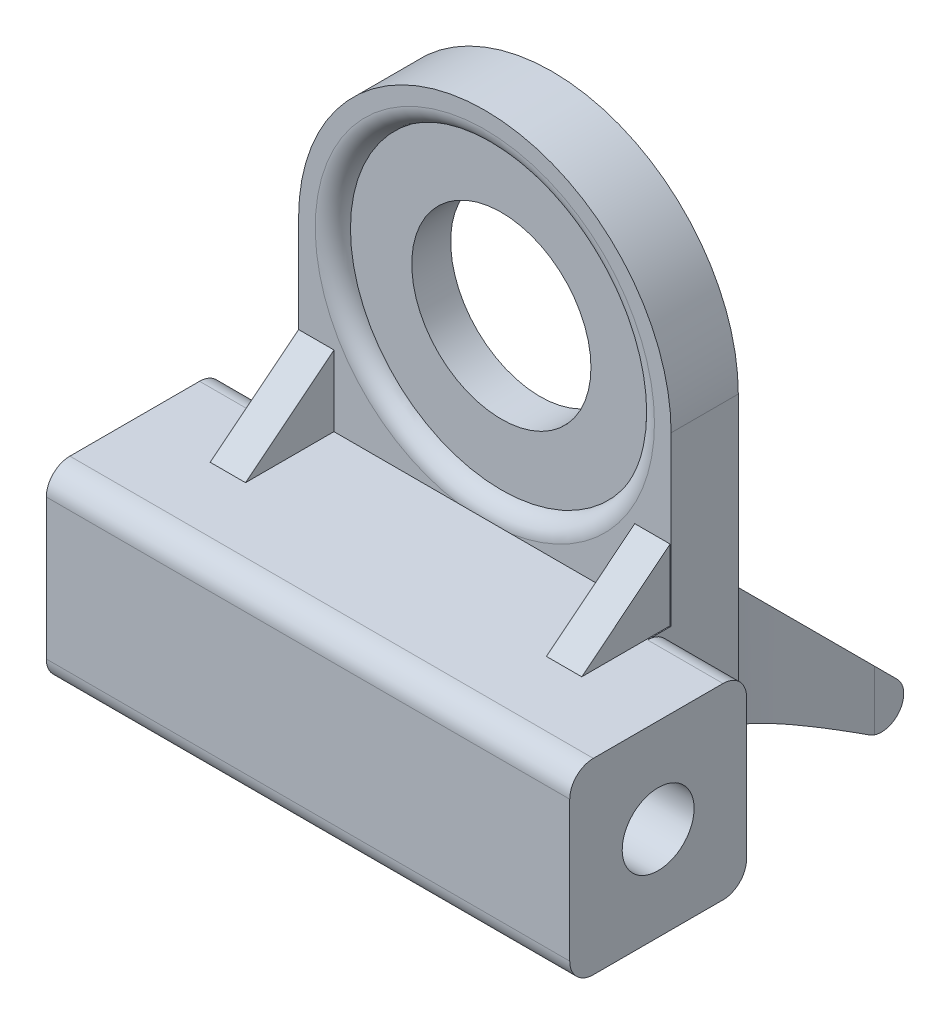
ISO-10303-21;
HEADER;
FILE_DESCRIPTION(('STEP AP214'),'2;1');
FILE_NAME('part.step','',(''),(''),'','','');
FILE_SCHEMA(('AUTOMOTIVE_DESIGN { 1 0 10303 214 1 1 1 1 }'));
ENDSEC;
DATA;
#1=APPLICATION_CONTEXT('core data for automotive mechanical design processes');
#2=APPLICATION_PROTOCOL_DEFINITION('international standard','automotive_design',2000,#1);
#3=PRODUCT_CONTEXT('',#1,'mechanical');
#4=PRODUCT('Part','Part','',(#3));
#5=PRODUCT_RELATED_PRODUCT_CATEGORY('part','',(#4));
#6=PRODUCT_DEFINITION_FORMATION('','',#4);
#7=PRODUCT_DEFINITION_CONTEXT('part definition',#1,'design');
#8=PRODUCT_DEFINITION('design','',#6,#7);
#9=PRODUCT_DEFINITION_SHAPE('','',#8);
#10=(LENGTH_UNIT() NAMED_UNIT(*) SI_UNIT(.MILLI.,.METRE.));
#11=(NAMED_UNIT(*) PLANE_ANGLE_UNIT() SI_UNIT($,.RADIAN.));
#12=(NAMED_UNIT(*) SI_UNIT($,.STERADIAN.) SOLID_ANGLE_UNIT());
#13=UNCERTAINTY_MEASURE_WITH_UNIT(LENGTH_MEASURE(1.E-05),#10,'distance_accuracy_value','');
#14=(GEOMETRIC_REPRESENTATION_CONTEXT(3) GLOBAL_UNCERTAINTY_ASSIGNED_CONTEXT((#13)) GLOBAL_UNIT_ASSIGNED_CONTEXT((#10,
#11,#12)) REPRESENTATION_CONTEXT('',''));
#15=CARTESIAN_POINT('',(0.,0.,0.));
#16=DIRECTION('',(0.,0.,1.));
#17=DIRECTION('',(1.,0.,0.));
#18=AXIS2_PLACEMENT_3D('',#15,#16,#17);
#19=CARTESIAN_POINT('',(-12.8,-8.21421356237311,0.));
#20=DIRECTION('',(1.,0.,0.));
#21=DIRECTION('',(0.,1.,0.));
#22=AXIS2_PLACEMENT_3D('',#19,#20,#21);
#23=PLANE('',#22);
#24=DIRECTION('',(0.,0.624695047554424,-0.78086880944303));
#25=VECTOR('',#24,1.);
#26=CARTESIAN_POINT('',(-12.8,-5.43372575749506,2.22439024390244));
#27=LINE('',#26,#25);
#28=CARTESIAN_POINT('',(-12.8,-14.2142135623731,13.2));
#29=VERTEX_POINT('',#28);
#30=CARTESIAN_POINT('',(-12.8,-8.21421356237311,5.7));
#31=VERTEX_POINT('',#30);
#32=EDGE_CURVE('E86',#29,#31,#27,.T.);
#33=ORIENTED_EDGE('',*,*,#32,.F.);
#34=DIRECTION('',(0.,0.,1.));
#35=VECTOR('',#34,1.);
#36=CARTESIAN_POINT('',(-12.8,-14.2142135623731,0.));
#37=LINE('',#36,#35);
#38=CARTESIAN_POINT('',(-12.8,-14.2142135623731,5.7));
#39=VERTEX_POINT('',#38);
#40=EDGE_CURVE('E101',#39,#29,#37,.T.);
#41=ORIENTED_EDGE('',*,*,#40,.F.);
#42=DIRECTION('',(0.,-1.,0.));
#43=VECTOR('',#42,1.);
#44=CARTESIAN_POINT('',(-12.8,-8.21421356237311,5.7));
#45=LINE('',#44,#43);
#46=EDGE_CURVE('E13',#31,#39,#45,.T.);
#47=ORIENTED_EDGE('',*,*,#46,.F.);
#48=EDGE_LOOP('',(#33,#41,#47));
#49=FACE_BOUND('',#48,.T.);
#50=ADVANCED_FACE('F51',(#49),#23,.T.);
#51=CARTESIAN_POINT('',(0.,-8.2142135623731,5.7));
#52=DIRECTION('',(0.,0.,1.));
#53=DIRECTION('',(0.,-1.,0.));
#54=AXIS2_PLACEMENT_3D('',#51,#52,#53);
#55=PLANE('',#54);
#56=DIRECTION('',(-1.,0.,0.));
#57=VECTOR('',#56,1.);
#58=CARTESIAN_POINT('',(0.,-14.2142135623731,5.7));
#59=LINE('',#58,#57);
#60=CARTESIAN_POINT('',(-15.8,-14.2142135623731,5.7));
#61=VERTEX_POINT('',#60);
#62=EDGE_CURVE('E72',#39,#61,#59,.T.);
#63=ORIENTED_EDGE('',*,*,#62,.T.);
#64=DIRECTION('',(0.,-1.,0.));
#65=VECTOR('',#64,1.);
#66=CARTESIAN_POINT('',(-15.8,-8.21421356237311,5.7));
#67=LINE('',#66,#65);
#68=CARTESIAN_POINT('',(-15.8,-8.21421356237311,5.7));
#69=VERTEX_POINT('',#68);
#70=EDGE_CURVE('E58',#69,#61,#67,.T.);
#71=ORIENTED_EDGE('',*,*,#70,.F.);
#72=DIRECTION('',(-1.,0.,0.));
#73=VECTOR('',#72,1.);
#74=CARTESIAN_POINT('',(0.,-8.2142135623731,5.7));
#75=LINE('',#74,#73);
#76=EDGE_CURVE('E83',#31,#69,#75,.T.);
#77=ORIENTED_EDGE('',*,*,#76,.F.);
#78=ORIENTED_EDGE('',*,*,#46,.T.);
#79=EDGE_LOOP('',(#63,#71,#77,#78));
#80=FACE_BOUND('',#79,.T.);
#81=ADVANCED_FACE('F96',(#80),#55,.F.);
#82=CARTESIAN_POINT('',(-15.8,-8.21421356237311,0.));
#83=DIRECTION('',(1.,0.,0.));
#84=DIRECTION('',(0.,1.,0.));
#85=AXIS2_PLACEMENT_3D('',#82,#83,#84);
#86=PLANE('',#85);
#87=DIRECTION('',(0.,0.,1.));
#88=VECTOR('',#87,1.);
#89=CARTESIAN_POINT('',(-15.8,-14.2142135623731,0.));
#90=LINE('',#89,#88);
#91=CARTESIAN_POINT('',(-15.8,-14.2142135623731,13.2));
#92=VERTEX_POINT('',#91);
#93=EDGE_CURVE('E93',#61,#92,#90,.T.);
#94=ORIENTED_EDGE('',*,*,#93,.T.);
#95=DIRECTION('',(0.,-0.624695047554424,0.78086880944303));
#96=VECTOR('',#95,1.);
#97=CARTESIAN_POINT('',(-15.8,-8.21421356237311,5.7));
#98=LINE('',#97,#96);
#99=EDGE_CURVE('E65',#69,#92,#98,.T.);
#100=ORIENTED_EDGE('',*,*,#99,.F.);
#101=ORIENTED_EDGE('',*,*,#70,.T.);
#102=EDGE_LOOP('',(#94,#100,#101));
#103=FACE_BOUND('',#102,.T.);
#104=ADVANCED_FACE('F91',(#103),#86,.F.);
#105=CARTESIAN_POINT('',(0.,-14.2142135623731,0.));
#106=DIRECTION('',(0.,1.,0.));
#107=DIRECTION('',(-1.,0.,0.));
#108=AXIS2_PLACEMENT_3D('',#105,#106,#107);
#109=PLANE('',#108);
#110=ORIENTED_EDGE('',*,*,#40,.T.);
#111=DIRECTION('',(1.,0.,0.));
#112=VECTOR('',#111,1.);
#113=CARTESIAN_POINT('',(0.,-14.2142135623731,13.2));
#114=LINE('',#113,#112);
#115=EDGE_CURVE('E88',#92,#29,#114,.T.);
#116=ORIENTED_EDGE('',*,*,#115,.F.);
#117=ORIENTED_EDGE('',*,*,#93,.F.);
#118=ORIENTED_EDGE('',*,*,#62,.F.);
#119=EDGE_LOOP('',(#110,#116,#117,#118));
#120=FACE_BOUND('',#119,.T.);
#121=ADVANCED_FACE('F106',(#120),#109,.F.);
#122=CARTESIAN_POINT('',(-9.8,-8.21421356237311,5.7));
#123=DIRECTION('',(0.,-0.78086880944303,-0.624695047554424));
#124=DIRECTION('',(0.,0.624695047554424,-0.78086880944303));
#125=AXIS2_PLACEMENT_3D('',#122,#123,#124);
#126=PLANE('',#125);
#127=ORIENTED_EDGE('',*,*,#32,.T.);
#128=ORIENTED_EDGE('',*,*,#76,.T.);
#129=ORIENTED_EDGE('',*,*,#99,.T.);
#130=ORIENTED_EDGE('',*,*,#115,.T.);
#131=EDGE_LOOP('',(#127,#128,#129,#130));
#132=FACE_BOUND('',#131,.T.);
#133=ADVANCED_FACE('F84',(#132),#126,.F.);
#134=CLOSED_SHELL('',(#50,#81,#104,#121,#133));
#135=MANIFOLD_SOLID_BREP('B2',#134);
#136=CARTESIAN_POINT('',(-23.5,-14.2142135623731,5.7));
#137=DIRECTION('',(0.,1.,0.));
#138=DIRECTION('',(-1.,0.,0.));
#139=AXIS2_PLACEMENT_3D('',#136,#137,#138);
#140=PLANE('',#139);
#141=DIRECTION('',(1.,0.,0.));
#142=VECTOR('',#141,1.);
#143=CARTESIAN_POINT('',(-23.5,-14.2142135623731,5.7));
#144=LINE('',#143,#142);
#145=CARTESIAN_POINT('',(-15.8,-14.2142135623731,5.7));
#146=VERTEX_POINT('',#145);
#147=CARTESIAN_POINT('',(-2.22595438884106,-14.2142135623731,5.7));
#148=VERTEX_POINT('',#147);
#149=EDGE_CURVE('E487',#146,#148,#144,.T.);
#150=ORIENTED_EDGE('',*,*,#149,.F.);
#151=DIRECTION('',(0.,0.,1.));
#152=VECTOR('',#151,1.);
#153=CARTESIAN_POINT('',(-15.8,-14.2142135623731,5.7));
#154=LINE('',#153,#152);
#155=CARTESIAN_POINT('',(-15.8,-14.2142135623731,7.7));
#156=VERTEX_POINT('',#155);
#157=EDGE_CURVE('E169',#146,#156,#154,.T.);
#158=ORIENTED_EDGE('',*,*,#157,.T.);
#159=DIRECTION('',(1.,0.,0.));
#160=VECTOR('',#159,1.);
#161=CARTESIAN_POINT('',(-23.5,-14.2142135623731,7.7));
#162=LINE('',#161,#160);
#163=CARTESIAN_POINT('',(-22.2,-14.2142135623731,7.7));
#164=VERTEX_POINT('',#163);
#165=EDGE_CURVE('E670',#156,#164,#162,.F.);
#166=ORIENTED_EDGE('',*,*,#165,.T.);
#167=DIRECTION('',(0.,0.,-1.));
#168=VECTOR('',#167,1.);
#169=CARTESIAN_POINT('',(-22.2,-14.2142135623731,5.7));
#170=LINE('',#169,#168);
#171=CARTESIAN_POINT('',(-22.2,-14.2142135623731,18.7));
#172=VERTEX_POINT('',#171);
#173=EDGE_CURVE('E480',#172,#164,#170,.T.);
#174=ORIENTED_EDGE('',*,*,#173,.F.);
#175=DIRECTION('',(1.,0.,0.));
#176=VECTOR('',#175,1.);
#177=CARTESIAN_POINT('',(-23.5,-14.2142135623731,18.7));
#178=LINE('',#177,#176);
#179=CARTESIAN_POINT('',(22.2,-14.2142135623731,18.7));
#180=VERTEX_POINT('',#179);
#181=EDGE_CURVE('E678',#172,#180,#178,.T.);
#182=ORIENTED_EDGE('',*,*,#181,.T.);
#183=DIRECTION('',(0.,0.,1.));
#184=VECTOR('',#183,1.);
#185=CARTESIAN_POINT('',(22.2,-14.2142135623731,20.7));
#186=LINE('',#185,#184);
#187=CARTESIAN_POINT('',(22.2,-14.2142135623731,7.7));
#188=VERTEX_POINT('',#187);
#189=EDGE_CURVE('E467',#188,#180,#186,.T.);
#190=ORIENTED_EDGE('',*,*,#189,.F.);
#191=DIRECTION('',(-1.,0.,0.));
#192=VECTOR('',#191,1.);
#193=CARTESIAN_POINT('',(-23.5,-14.2142135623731,7.7));
#194=LINE('',#193,#192);
#195=CARTESIAN_POINT('',(15.8,-14.2142135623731,7.7));
#196=VERTEX_POINT('',#195);
#197=EDGE_CURVE('E681',#188,#196,#194,.T.);
#198=ORIENTED_EDGE('',*,*,#197,.T.);
#199=DIRECTION('',(0.,0.,-1.));
#200=VECTOR('',#199,1.);
#201=CARTESIAN_POINT('',(15.8,-14.2142135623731,5.7));
#202=LINE('',#201,#200);
#203=CARTESIAN_POINT('',(15.8,-14.2142135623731,5.7));
#204=VERTEX_POINT('',#203);
#205=EDGE_CURVE('E666',#196,#204,#202,.T.);
#206=ORIENTED_EDGE('',*,*,#205,.T.);
#207=CARTESIAN_POINT('',(2.22595438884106,-14.2142135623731,5.7));
#208=VERTEX_POINT('',#207);
#209=EDGE_CURVE('E483',#208,#204,#144,.T.);
#210=ORIENTED_EDGE('',*,*,#209,.F.);
#211=EDGE_CURVE('E486',#148,#208,#144,.T.);
#212=ORIENTED_EDGE('',*,*,#211,.F.);
#213=EDGE_LOOP('',(#150,#158,#166,#174,#182,#190,#198,#206,#210,#212));
#214=FACE_BOUND('',#213,.T.);
#215=DIRECTION('',(0.,0.,1.));
#216=VECTOR('',#215,1.);
#217=CARTESIAN_POINT('',(12.7188416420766,-14.2142135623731,5.70011980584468));
#218=LINE('',#217,#216);
#219=CARTESIAN_POINT('',(12.7188416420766,-14.2142135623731,5.70011980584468));
#220=VERTEX_POINT('',#219);
#221=CARTESIAN_POINT('',(12.7188416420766,-14.2142135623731,13.2001198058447));
#222=VERTEX_POINT('',#221);
#223=EDGE_CURVE('E347',#220,#222,#218,.T.);
#224=ORIENTED_EDGE('',*,*,#223,.F.);
#225=DIRECTION('',(-1.,0.,0.));
#226=VECTOR('',#225,1.);
#227=CARTESIAN_POINT('',(12.7188416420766,-14.2142135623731,5.70011980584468));
#228=LINE('',#227,#226);
#229=CARTESIAN_POINT('',(15.7188416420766,-14.2142135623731,5.70011980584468));
#230=VERTEX_POINT('',#229);
#231=EDGE_CURVE('E357',#230,#220,#228,.T.);
#232=ORIENTED_EDGE('',*,*,#231,.F.);
#233=DIRECTION('',(0.,0.,-1.));
#234=VECTOR('',#233,1.);
#235=CARTESIAN_POINT('',(15.7188416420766,-14.2142135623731,5.70011980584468));
#236=LINE('',#235,#234);
#237=CARTESIAN_POINT('',(15.7188416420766,-14.2142135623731,13.2001198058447));
#238=VERTEX_POINT('',#237);
#239=EDGE_CURVE('E346',#238,#230,#236,.T.);
#240=ORIENTED_EDGE('',*,*,#239,.F.);
#241=DIRECTION('',(1.,0.,0.));
#242=VECTOR('',#241,1.);
#243=CARTESIAN_POINT('',(12.7188416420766,-14.2142135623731,13.2001198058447));
#244=LINE('',#243,#242);
#245=EDGE_CURVE('E335',#222,#238,#244,.T.);
#246=ORIENTED_EDGE('',*,*,#245,.F.);
#247=EDGE_LOOP('',(#224,#232,#240,#246));
#248=FACE_BOUND('',#247,.T.);
#249=ADVANCED_FACE('F154',(#214,#248),#140,.T.);
#250=CARTESIAN_POINT('',(15.8,-41.6425146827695,-24.7601209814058));
#251=DIRECTION('',(1.,0.,0.));
#252=DIRECTION('',(0.,1.,0.));
#253=AXIS2_PLACEMENT_3D('',#250,#251,#252);
#254=CYLINDRICAL_SURFACE('',#253,1.88668826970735);
#255=CARTESIAN_POINT('',(3.16977036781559,-43.2355890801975,-23.7493259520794));
#256=CARTESIAN_POINT('',(3.17187117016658,-43.2780337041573,-23.8162971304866));
#257=CARTESIAN_POINT('',(3.17420198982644,-43.3160073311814,-23.8853648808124));
#258=CARTESIAN_POINT('',(3.17932366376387,-43.3830125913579,-24.0276935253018));
#259=CARTESIAN_POINT('',(3.18211451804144,-43.4120442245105,-24.1009544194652));
#260=CARTESIAN_POINT('',(3.18513538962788,-43.4366048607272,-24.1763118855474));
#261=B_SPLINE_CURVE_WITH_KNOTS('',3,(#255,#256,#257,#258,#259,#260),.UNSPECIFIED.,.F.,.F.,(4,2,
4),(0.,0.236558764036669,0.473117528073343),.UNSPECIFIED.);
#262=CARTESIAN_POINT('',(3.16977036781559,-43.2355890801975,-23.7493259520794));
#263=VERTEX_POINT('',#262);
#264=CARTESIAN_POINT('',(3.18513538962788,-43.4366048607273,-24.1763118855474));
#265=VERTEX_POINT('',#264);
#266=EDGE_CURVE('E407',#263,#265,#261,.T.);
#267=ORIENTED_EDGE('',*,*,#266,.F.);
#268=DIRECTION('',(1.,0.,0.));
#269=VECTOR('',#268,1.);
#270=CARTESIAN_POINT('',(-15.8,-43.2355890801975,-23.7493259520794));
#271=LINE('',#270,#269);
#272=CARTESIAN_POINT('',(-3.16977036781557,-43.2355890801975,-23.7493259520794));
#273=VERTEX_POINT('',#272);
#274=EDGE_CURVE('E532',#273,#263,#271,.T.);
#275=ORIENTED_EDGE('',*,*,#274,.F.);
#276=CARTESIAN_POINT('',(-3.18513538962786,-43.4366048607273,-24.1763118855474));
#277=CARTESIAN_POINT('',(-3.18211451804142,-43.4120442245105,-24.1009544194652));
#278=CARTESIAN_POINT('',(-3.17932366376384,-43.3830125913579,-24.0276935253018));
#279=CARTESIAN_POINT('',(-3.17420198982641,-43.3160073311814,-23.8853648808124));
#280=CARTESIAN_POINT('',(-3.17187117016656,-43.2780337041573,-23.8162971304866));
#281=CARTESIAN_POINT('',(-3.16977036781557,-43.2355890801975,-23.7493259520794));
#282=B_SPLINE_CURVE_WITH_KNOTS('',3,(#276,#277,#278,#279,#280,#281),.UNSPECIFIED.,.F.,.F.,(4,2,
4),(0.,0.23655876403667,0.473117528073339),.UNSPECIFIED.);
#283=CARTESIAN_POINT('',(-3.18513538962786,-43.4366048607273,-24.1763118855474));
#284=VERTEX_POINT('',#283);
#285=EDGE_CURVE('E442',#284,#273,#282,.T.);
#286=ORIENTED_EDGE('',*,*,#285,.F.);
#287=CARTESIAN_POINT('',(-3.18513538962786,-41.6425146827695,-24.7601209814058));
#288=DIRECTION('',(1.,0.,0.));
#289=DIRECTION('',(0.,1.,0.));
#290=AXIS2_PLACEMENT_3D('',#287,#288,#289);
#291=CIRCLE('',#290,1.88668826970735);
#292=CARTESIAN_POINT('',(-3.18513538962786,-40.3084246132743,-26.094211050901));
#293=VERTEX_POINT('',#292);
#294=EDGE_CURVE('E441',#293,#284,#291,.F.);
#295=ORIENTED_EDGE('',*,*,#294,.F.);
#296=DIRECTION('',(1.,0.,0.));
#297=VECTOR('',#296,1.);
#298=CARTESIAN_POINT('',(-15.8,-40.3084246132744,-26.094211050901));
#299=LINE('',#298,#297);
#300=CARTESIAN_POINT('',(3.18513538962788,-40.3084246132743,-26.094211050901));
#301=VERTEX_POINT('',#300);
#302=EDGE_CURVE('E530',#301,#293,#299,.F.);
#303=ORIENTED_EDGE('',*,*,#302,.F.);
#304=CARTESIAN_POINT('',(3.18513538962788,-41.6425146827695,-24.7601209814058));
#305=DIRECTION('',(-1.,0.,0.));
#306=DIRECTION('',(0.,-1.,0.));
#307=AXIS2_PLACEMENT_3D('',#304,#305,#306);
#308=CIRCLE('',#307,1.88668826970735);
#309=EDGE_CURVE('E420',#265,#301,#308,.F.);
#310=ORIENTED_EDGE('',*,*,#309,.F.);
#311=EDGE_LOOP('',(#267,#275,#286,#295,#303,#310));
#312=FACE_BOUND('',#311,.T.);
#313=ADVANCED_FACE('F575',(#312),#254,.T.);
#314=CARTESIAN_POINT('',(-23.5,-14.2142135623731,5.7));
#315=DIRECTION('',(0.,0.,-1.));
#316=DIRECTION('',(0.,1.,0.));
#317=AXIS2_PLACEMENT_3D('',#314,#315,#316);
#318=PLANE('',#317);
#319=DIRECTION('',(0.,1.,0.));
#320=VECTOR('',#319,1.);
#321=CARTESIAN_POINT('',(22.2,-30.1142135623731,5.7));
#322=LINE('',#321,#320);
#323=CARTESIAN_POINT('',(22.2,-28.1142135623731,5.7));
#324=VERTEX_POINT('',#323);
#325=CARTESIAN_POINT('',(22.2,-16.2142135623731,5.7));
#326=VERTEX_POINT('',#325);
#327=EDGE_CURVE('E464',#324,#326,#322,.T.);
#328=ORIENTED_EDGE('',*,*,#327,.F.);
#329=DIRECTION('',(1.,0.,0.));
#330=VECTOR('',#329,1.);
#331=CARTESIAN_POINT('',(-23.5,-28.1142135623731,5.7));
#332=LINE('',#331,#330);
#333=CARTESIAN_POINT('',(15.8,-28.1142135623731,5.7));
#334=VERTEX_POINT('',#333);
#335=EDGE_CURVE('E709',#324,#334,#332,.F.);
#336=ORIENTED_EDGE('',*,*,#335,.T.);
#337=DIRECTION('',(0.,1.,0.));
#338=VECTOR('',#337,1.);
#339=CARTESIAN_POINT('',(15.8,-30.1142135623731,5.7));
#340=LINE('',#339,#338);
#341=CARTESIAN_POINT('',(15.8,-16.2142135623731,5.7));
#342=VERTEX_POINT('',#341);
#343=EDGE_CURVE('E457',#334,#342,#340,.T.);
#344=ORIENTED_EDGE('',*,*,#343,.T.);
#345=DIRECTION('',(-1.,0.,0.));
#346=VECTOR('',#345,1.);
#347=CARTESIAN_POINT('',(-23.5,-16.2142135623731,5.7));
#348=LINE('',#347,#346);
#349=EDGE_CURVE('E707',#342,#326,#348,.F.);
#350=ORIENTED_EDGE('',*,*,#349,.T.);
#351=EDGE_LOOP('',(#328,#336,#344,#350));
#352=FACE_BOUND('',#351,.T.);
#353=ADVANCED_FACE('F607',(#352),#318,.T.);
#354=CARTESIAN_POINT('',(15.8,0.,0.));
#355=DIRECTION('',(1.,0.,0.));
#356=DIRECTION('',(0.,1.,0.));
#357=AXIS2_PLACEMENT_3D('',#354,#355,#356);
#358=PLANE('',#357);
#359=DIRECTION('',(0.,1.,0.));
#360=VECTOR('',#359,1.);
#361=CARTESIAN_POINT('',(15.8,-55.2142135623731,0.));
#362=LINE('',#361,#360);
#363=CARTESIAN_POINT('',(15.8,-30.1142135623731,0.));
#364=VERTEX_POINT('',#363);
#365=CARTESIAN_POINT('',(15.8,-14.2142135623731,0.));
#366=VERTEX_POINT('',#365);
#367=EDGE_CURVE('E377',#364,#366,#362,.T.);
#368=ORIENTED_EDGE('',*,*,#367,.T.);
#369=DIRECTION('',(0.,1.,0.));
#370=VECTOR('',#369,1.);
#371=CARTESIAN_POINT('',(15.8,0.,0.));
#372=LINE('',#371,#370);
#373=CARTESIAN_POINT('',(15.8,0.,0.));
#374=VERTEX_POINT('',#373);
#375=EDGE_CURVE('E495',#366,#374,#372,.T.);
#376=ORIENTED_EDGE('',*,*,#375,.T.);
#377=DIRECTION('',(0.,0.,1.));
#378=VECTOR('',#377,1.);
#379=CARTESIAN_POINT('',(15.8,0.,0.));
#380=LINE('',#379,#378);
#381=CARTESIAN_POINT('',(15.8,0.,5.7));
#382=VERTEX_POINT('',#381);
#383=EDGE_CURVE('E502',#374,#382,#380,.T.);
#384=ORIENTED_EDGE('',*,*,#383,.T.);
#385=DIRECTION('',(0.,1.,0.));
#386=VECTOR('',#385,1.);
#387=CARTESIAN_POINT('',(15.8,0.,5.7));
#388=LINE('',#387,#386);
#389=EDGE_CURVE('E496',#204,#382,#388,.T.);
#390=ORIENTED_EDGE('',*,*,#389,.F.);
#391=ORIENTED_EDGE('',*,*,#205,.F.);
#392=CARTESIAN_POINT('',(15.8,-16.2142135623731,7.7));
#393=DIRECTION('',(1.,0.,0.));
#394=DIRECTION('',(0.,1.,0.));
#395=AXIS2_PLACEMENT_3D('',#392,#393,#394);
#396=CIRCLE('',#395,2.);
#397=EDGE_CURVE('E49',#196,#342,#396,.F.);
#398=ORIENTED_EDGE('',*,*,#397,.T.);
#399=ORIENTED_EDGE('',*,*,#343,.F.);
#400=CARTESIAN_POINT('',(15.8,-28.1142135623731,7.7));
#401=DIRECTION('',(1.,0.,0.));
#402=DIRECTION('',(0.,1.,0.));
#403=AXIS2_PLACEMENT_3D('',#400,#401,#402);
#404=CIRCLE('',#403,2.);
#405=CARTESIAN_POINT('',(15.8,-30.1142135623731,7.7));
#406=VERTEX_POINT('',#405);
#407=EDGE_CURVE('E162',#334,#406,#404,.F.);
#408=ORIENTED_EDGE('',*,*,#407,.T.);
#409=DIRECTION('',(0.,0.,-1.));
#410=VECTOR('',#409,1.);
#411=CARTESIAN_POINT('',(15.8,-30.1142135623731,5.7));
#412=LINE('',#411,#410);
#413=EDGE_CURVE('E448',#406,#364,#412,.T.);
#414=ORIENTED_EDGE('',*,*,#413,.T.);
#415=EDGE_LOOP('',(#368,#376,#384,#390,#391,#398,#399,#408,#414));
#416=FACE_BOUND('',#415,.T.);
#417=ADVANCED_FACE('F619',(#416),#358,.T.);
#418=CARTESIAN_POINT('',(0.,0.,5.7));
#419=DIRECTION('',(0.,0.,-1.));
#420=DIRECTION('',(-1.,0.,0.));
#421=AXIS2_PLACEMENT_3D('',#418,#419,#420);
#422=CYLINDRICAL_SURFACE('',#421,15.8);
#423=CARTESIAN_POINT('',(0.,0.,5.7));
#424=DIRECTION('',(0.,0.,1.));
#425=DIRECTION('',(1.,0.,0.));
#426=AXIS2_PLACEMENT_3D('',#423,#424,#425);
#427=CIRCLE('',#426,15.8);
#428=CARTESIAN_POINT('',(-15.8,0.,5.7));
#429=VERTEX_POINT('',#428);
#430=EDGE_CURVE('E517',#382,#429,#427,.T.);
#431=ORIENTED_EDGE('',*,*,#430,.F.);
#432=ORIENTED_EDGE('',*,*,#383,.F.);
#433=CARTESIAN_POINT('',(0.,0.,0.));
#434=DIRECTION('',(0.,0.,1.));
#435=DIRECTION('',(1.,0.,0.));
#436=AXIS2_PLACEMENT_3D('',#433,#434,#435);
#437=CIRCLE('',#436,15.8);
#438=CARTESIAN_POINT('',(-15.8,0.,0.));
#439=VERTEX_POINT('',#438);
#440=EDGE_CURVE('E516',#374,#439,#437,.T.);
#441=ORIENTED_EDGE('',*,*,#440,.T.);
#442=DIRECTION('',(0.,0.,1.));
#443=VECTOR('',#442,1.);
#444=CARTESIAN_POINT('',(-15.8,0.,0.));
#445=LINE('',#444,#443);
#446=EDGE_CURVE('E498',#439,#429,#445,.T.);
#447=ORIENTED_EDGE('',*,*,#446,.T.);
#448=EDGE_LOOP('',(#431,#432,#441,#447));
#449=FACE_BOUND('',#448,.T.);
#450=ADVANCED_FACE('F622',(#449),#422,.T.);
#451=CARTESIAN_POINT('',(0.,0.,5.7));
#452=DIRECTION('',(0.,0.,1.));
#453=DIRECTION('',(1.,0.,0.));
#454=AXIS2_PLACEMENT_3D('',#451,#452,#453);
#455=PLANE('',#454);
#456=ORIENTED_EDGE('',*,*,#209,.T.);
#457=ORIENTED_EDGE('',*,*,#389,.T.);
#458=ORIENTED_EDGE('',*,*,#430,.T.);
#459=DIRECTION('',(0.,-1.,0.));
#460=VECTOR('',#459,1.);
#461=CARTESIAN_POINT('',(-15.8,0.,5.7));
#462=LINE('',#461,#460);
#463=EDGE_CURVE('E491',#429,#146,#462,.T.);
#464=ORIENTED_EDGE('',*,*,#463,.T.);
#465=ORIENTED_EDGE('',*,*,#149,.T.);
#466=CARTESIAN_POINT('',(0.,0.,5.7));
#467=DIRECTION('',(0.,0.,1.));
#468=DIRECTION('',(1.,0.,0.));
#469=AXIS2_PLACEMENT_3D('',#466,#467,#468);
#470=CIRCLE('',#469,14.3874507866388);
#471=EDGE_CURVE('E526',#148,#208,#470,.F.);
#472=ORIENTED_EDGE('',*,*,#471,.T.);
#473=EDGE_LOOP('',(#456,#457,#458,#464,#465,#472));
#474=FACE_BOUND('',#473,.T.);
#475=ADVANCED_FACE('F640',(#474),#455,.T.);
#476=CARTESIAN_POINT('',(0.,0.,0.));
#477=DIRECTION('',(0.,0.,1.));
#478=DIRECTION('',(1.,0.,0.));
#479=AXIS2_PLACEMENT_3D('',#476,#477,#478);
#480=PLANE('',#479);
#481=ORIENTED_EDGE('',*,*,#375,.F.);
#482=DIRECTION('',(1.,0.,0.));
#483=VECTOR('',#482,1.);
#484=CARTESIAN_POINT('',(-15.8,-14.2142135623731,0.));
#485=LINE('',#484,#483);
#486=CARTESIAN_POINT('',(0.,-14.2142135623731,0.));
#487=VERTEX_POINT('',#486);
#488=EDGE_CURVE('E452',#487,#366,#485,.T.);
#489=ORIENTED_EDGE('',*,*,#488,.F.);
#490=CARTESIAN_POINT('',(0.,0.,0.));
#491=DIRECTION('',(0.,0.,1.));
#492=DIRECTION('',(1.,0.,0.));
#493=AXIS2_PLACEMENT_3D('',#490,#491,#492);
#494=CIRCLE('',#493,14.2142135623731);
#495=EDGE_CURVE('E520',#487,#487,#494,.T.);
#496=ORIENTED_EDGE('',*,*,#495,.T.);
#497=CARTESIAN_POINT('',(-15.8,-14.2142135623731,0.));
#498=VERTEX_POINT('',#497);
#499=EDGE_CURVE('E455',#498,#487,#485,.T.);
#500=ORIENTED_EDGE('',*,*,#499,.F.);
#501=DIRECTION('',(0.,-1.,0.));
#502=VECTOR('',#501,1.);
#503=CARTESIAN_POINT('',(-15.8,0.,0.));
#504=LINE('',#503,#502);
#505=EDGE_CURVE('E492',#439,#498,#504,.T.);
#506=ORIENTED_EDGE('',*,*,#505,.F.);
#507=ORIENTED_EDGE('',*,*,#440,.F.);
#508=EDGE_LOOP('',(#481,#489,#496,#500,#506,#507));
#509=FACE_BOUND('',#508,.T.);
#510=ADVANCED_FACE('F638',(#509),#480,.F.);
#511=CARTESIAN_POINT('',(0.,0.,4.3));
#512=DIRECTION('',(0.,0.,1.));
#513=DIRECTION('',(1.,0.,0.));
#514=AXIS2_PLACEMENT_3D('',#511,#512,#513);
#515=PLANE('',#514);
#516=CARTESIAN_POINT('',(0.,0.,4.3));
#517=DIRECTION('',(0.,0.,1.));
#518=DIRECTION('',(1.,0.,0.));
#519=AXIS2_PLACEMENT_3D('',#516,#517,#518);
#520=CIRCLE('',#519,7.6);
#521=CARTESIAN_POINT('',(7.6,0.,4.3));
#522=VERTEX_POINT('',#521);
#523=EDGE_CURVE('E505',#522,#522,#520,.T.);
#524=ORIENTED_EDGE('',*,*,#523,.F.);
#525=EDGE_LOOP('',(#524));
#526=FACE_BOUND('',#525,.T.);
#527=CARTESIAN_POINT('',(0.,0.,4.3));
#528=DIRECTION('',(0.,0.,1.));
#529=DIRECTION('',(1.,0.,0.));
#530=AXIS2_PLACEMENT_3D('',#527,#528,#529);
#531=CIRCLE('',#530,12.8);
#532=CARTESIAN_POINT('',(12.8,0.,4.3));
#533=VERTEX_POINT('',#532);
#534=EDGE_CURVE('E513',#533,#533,#531,.T.);
#535=ORIENTED_EDGE('',*,*,#534,.T.);
#536=EDGE_LOOP('',(#535));
#537=FACE_BOUND('',#536,.T.);
#538=ADVANCED_FACE('F634',(#526,#537),#515,.T.);
#539=CARTESIAN_POINT('',(0.,0.,1.));
#540=DIRECTION('',(0.,0.,-1.));
#541=DIRECTION('',(-1.,0.,0.));
#542=AXIS2_PLACEMENT_3D('',#539,#540,#541);
#543=PLANE('',#542);
#544=CARTESIAN_POINT('',(0.,0.,1.));
#545=DIRECTION('',(0.,0.,-1.));
#546=DIRECTION('',(-1.,0.,0.));
#547=AXIS2_PLACEMENT_3D('',#544,#545,#546);
#548=CIRCLE('',#547,7.6);
#549=CARTESIAN_POINT('',(7.6,0.,1.));
#550=VERTEX_POINT('',#549);
#551=EDGE_CURVE('E509',#550,#550,#548,.T.);
#552=ORIENTED_EDGE('',*,*,#551,.F.);
#553=EDGE_LOOP('',(#552));
#554=FACE_BOUND('',#553,.T.);
#555=CARTESIAN_POINT('',(0.,0.,1.));
#556=DIRECTION('',(0.,0.,-1.));
#557=DIRECTION('',(-1.,0.,0.));
#558=AXIS2_PLACEMENT_3D('',#555,#556,#557);
#559=CIRCLE('',#558,12.8);
#560=CARTESIAN_POINT('',(-12.8,0.,1.));
#561=VERTEX_POINT('',#560);
#562=EDGE_CURVE('E510',#561,#561,#559,.T.);
#563=ORIENTED_EDGE('',*,*,#562,.T.);
#564=EDGE_LOOP('',(#563));
#565=FACE_BOUND('',#564,.T.);
#566=ADVANCED_FACE('F630',(#554,#565),#543,.T.);
#567=CARTESIAN_POINT('',(0.,0.,0.));
#568=DIRECTION('',(0.,0.,1.));
#569=DIRECTION('',(1.,0.,0.));
#570=AXIS2_PLACEMENT_3D('',#567,#568,#569);
#571=CYLINDRICAL_SURFACE('',#570,7.6);
#572=CARTESIAN_POINT('',(7.6,0.,1.));
#573=CARTESIAN_POINT('',(7.6,0.,1.034375));
#574=CARTESIAN_POINT('',(7.6,0.,1.06875));
#575=CARTESIAN_POINT('',(7.6,0.,1.1375));
#576=CARTESIAN_POINT('',(7.6,0.,1.171875));
#577=CARTESIAN_POINT('',(7.6,0.,1.240625));
#578=CARTESIAN_POINT('',(7.6,0.,1.275));
#579=CARTESIAN_POINT('',(7.6,0.,1.34375));
#580=CARTESIAN_POINT('',(7.6,0.,1.378125));
#581=CARTESIAN_POINT('',(7.6,0.,1.446875));
#582=CARTESIAN_POINT('',(7.6,0.,1.48125));
#583=CARTESIAN_POINT('',(7.6,0.,1.55));
#584=CARTESIAN_POINT('',(7.6,0.,1.584375));
#585=CARTESIAN_POINT('',(7.6,0.,1.653125));
#586=CARTESIAN_POINT('',(7.6,0.,1.6875));
#587=CARTESIAN_POINT('',(7.6,0.,1.75625));
#588=CARTESIAN_POINT('',(7.6,0.,1.790625));
#589=CARTESIAN_POINT('',(7.6,0.,1.859375));
#590=CARTESIAN_POINT('',(7.6,0.,1.89375));
#591=CARTESIAN_POINT('',(7.6,0.,1.9625));
#592=CARTESIAN_POINT('',(7.6,0.,1.996875));
#593=CARTESIAN_POINT('',(7.6,0.,2.065625));
#594=CARTESIAN_POINT('',(7.6,0.,2.1));
#595=CARTESIAN_POINT('',(7.6,0.,2.16875));
#596=CARTESIAN_POINT('',(7.6,0.,2.203125));
#597=CARTESIAN_POINT('',(7.6,0.,2.271875));
#598=CARTESIAN_POINT('',(7.6,0.,2.30625));
#599=CARTESIAN_POINT('',(7.6,0.,2.375));
#600=CARTESIAN_POINT('',(7.6,0.,2.409375));
#601=CARTESIAN_POINT('',(7.6,0.,2.478125));
#602=CARTESIAN_POINT('',(7.6,0.,2.5125));
#603=CARTESIAN_POINT('',(7.6,0.,2.58125));
#604=CARTESIAN_POINT('',(7.6,0.,2.615625));
#605=CARTESIAN_POINT('',(7.6,0.,2.684375));
#606=CARTESIAN_POINT('',(7.6,0.,2.71875));
#607=CARTESIAN_POINT('',(7.6,0.,2.7875));
#608=CARTESIAN_POINT('',(7.6,0.,2.821875));
#609=CARTESIAN_POINT('',(7.6,0.,2.890625));
#610=CARTESIAN_POINT('',(7.6,0.,2.925));
#611=CARTESIAN_POINT('',(7.6,0.,2.99375));
#612=CARTESIAN_POINT('',(7.6,0.,3.028125));
#613=CARTESIAN_POINT('',(7.6,0.,3.096875));
#614=CARTESIAN_POINT('',(7.6,0.,3.13125));
#615=CARTESIAN_POINT('',(7.6,0.,3.2));
#616=CARTESIAN_POINT('',(7.6,0.,3.234375));
#617=CARTESIAN_POINT('',(7.6,0.,3.303125));
#618=CARTESIAN_POINT('',(7.6,0.,3.3375));
#619=CARTESIAN_POINT('',(7.6,0.,3.40625));
#620=CARTESIAN_POINT('',(7.6,0.,3.440625));
#621=CARTESIAN_POINT('',(7.6,0.,3.509375));
#622=CARTESIAN_POINT('',(7.6,0.,3.54375));
#623=CARTESIAN_POINT('',(7.6,0.,3.6125));
#624=CARTESIAN_POINT('',(7.6,0.,3.646875));
#625=CARTESIAN_POINT('',(7.6,0.,3.715625));
#626=CARTESIAN_POINT('',(7.6,0.,3.75));
#627=CARTESIAN_POINT('',(7.6,0.,3.81875));
#628=CARTESIAN_POINT('',(7.6,0.,3.853125));
#629=CARTESIAN_POINT('',(7.6,0.,3.921875));
#630=CARTESIAN_POINT('',(7.6,0.,3.95625));
#631=CARTESIAN_POINT('',(7.6,0.,4.025));
#632=CARTESIAN_POINT('',(7.6,0.,4.059375));
#633=CARTESIAN_POINT('',(7.6,0.,4.128125));
#634=CARTESIAN_POINT('',(7.6,0.,4.1625));
#635=CARTESIAN_POINT('',(7.6,0.,4.23125));
#636=CARTESIAN_POINT('',(7.6,0.,4.265625));
#637=CARTESIAN_POINT('',(7.6,0.,4.3));
#638=B_SPLINE_CURVE_WITH_KNOTS('',3,(#572,#573,#574,#575,#576,#577,#578,#579,#580,#581,#582,
#583,#584,#585,#586,#587,#588,#589,#590,#591,#592,#593,#594,#595,#596,#597,#598,#599,#600,#601,
#602,#603,#604,#605,#606,#607,#608,#609,#610,#611,#612,#613,#614,#615,#616,#617,#618,#619,#620,
#621,#622,#623,#624,#625,#626,#627,#628,#629,#630,#631,#632,#633,#634,#635,#636,#637),
.UNSPECIFIED.,.F.,.F.,(4,2,2,2,2,2,2,2,2,2,2,2,2,2,2,2,2,2,2,2,2,2,2,2,2,2,2,2,2,2,2,2,4),(0.,
0.103125,0.20625,0.309375,0.4125,0.515625,0.61875,0.721875,0.825,0.928125,1.03125,1.134375,
1.2375,1.340625,1.44375,1.546875,1.65,1.753125,1.85625,1.959375,2.0625,2.165625,2.26875,
2.371875,2.475,2.578125,2.68125,2.784375,2.8875,2.990625,3.09375,3.196875,3.3),.UNSPECIFIED.);
#639=EDGE_CURVE('BSEAM627',#550,#522,#638,.T.);
#640=ORIENTED_EDGE('',*,*,#551,.T.);
#641=ORIENTED_EDGE('',*,*,#523,.T.);
#642=ORIENTED_EDGE('',*,*,#639,.T.);
#643=ORIENTED_EDGE('',*,*,#639,.F.);
#644=EDGE_LOOP('',(#640,#642,#641,#643));
#645=FACE_BOUND('',#644,.T.);
#646=ADVANCED_FACE('F627',(#645),#571,.F.);
#647=CARTESIAN_POINT('',(0.,0.,1.5));
#648=DIRECTION('',(0.,0.,1.));
#649=DIRECTION('',(1.,0.,0.));
#650=AXIS2_PLACEMENT_3D('',#647,#648,#649);
#651=TOROIDAL_SURFACE('',#650,14.2142135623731,1.5);
#652=ORIENTED_EDGE('',*,*,#495,.F.);
#653=EDGE_LOOP('',(#652));
#654=FACE_BOUND('',#653,.T.);
#655=ORIENTED_EDGE('',*,*,#562,.F.);
#656=EDGE_LOOP('',(#655));
#657=FACE_BOUND('',#656,.T.);
#658=ADVANCED_FACE('F626',(#654,#657),#651,.T.);
#659=CARTESIAN_POINT('',(-15.8,0.,0.));
#660=DIRECTION('',(-1.,0.,0.));
#661=DIRECTION('',(0.,-1.,0.));
#662=AXIS2_PLACEMENT_3D('',#659,#660,#661);
#663=PLANE('',#662);
#664=DIRECTION('',(0.,1.,0.));
#665=VECTOR('',#664,1.);
#666=CARTESIAN_POINT('',(-15.8,-55.2142135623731,0.));
#667=LINE('',#666,#665);
#668=CARTESIAN_POINT('',(-15.8,-30.1142135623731,0.));
#669=VERTEX_POINT('',#668);
#670=EDGE_CURVE('E759',#669,#498,#667,.T.);
#671=ORIENTED_EDGE('',*,*,#670,.F.);
#672=DIRECTION('',(0.,0.,-1.));
#673=VECTOR('',#672,1.);
#674=CARTESIAN_POINT('',(-15.8,-30.1142135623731,5.7));
#675=LINE('',#674,#673);
#676=CARTESIAN_POINT('',(-15.8,-30.1142135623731,7.7));
#677=VERTEX_POINT('',#676);
#678=EDGE_CURVE('E449',#677,#669,#675,.T.);
#679=ORIENTED_EDGE('',*,*,#678,.F.);
#680=CARTESIAN_POINT('',(-15.8,-28.1142135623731,7.7));
#681=DIRECTION('',(-1.,0.,0.));
#682=DIRECTION('',(0.,-1.,0.));
#683=AXIS2_PLACEMENT_3D('',#680,#681,#682);
#684=CIRCLE('',#683,2.);
#685=CARTESIAN_POINT('',(-15.8,-28.1142135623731,5.7));
#686=VERTEX_POINT('',#685);
#687=EDGE_CURVE('E717',#677,#686,#684,.F.);
#688=ORIENTED_EDGE('',*,*,#687,.T.);
#689=DIRECTION('',(0.,-1.,0.));
#690=VECTOR('',#689,1.);
#691=CARTESIAN_POINT('',(-15.8,0.,5.7));
#692=LINE('',#691,#690);
#693=CARTESIAN_POINT('',(-15.8,-16.2142135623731,5.7));
#694=VERTEX_POINT('',#693);
#695=EDGE_CURVE('E488',#694,#686,#692,.T.);
#696=ORIENTED_EDGE('',*,*,#695,.F.);
#697=CARTESIAN_POINT('',(-15.8,-16.2142135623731,7.7));
#698=DIRECTION('',(-1.,0.,0.));
#699=DIRECTION('',(0.,-1.,0.));
#700=AXIS2_PLACEMENT_3D('',#697,#698,#699);
#701=CIRCLE('',#700,2.);
#702=EDGE_CURVE('E675',#694,#156,#701,.F.);
#703=ORIENTED_EDGE('',*,*,#702,.T.);
#704=ORIENTED_EDGE('',*,*,#157,.F.);
#705=ORIENTED_EDGE('',*,*,#463,.F.);
#706=ORIENTED_EDGE('',*,*,#446,.F.);
#707=ORIENTED_EDGE('',*,*,#505,.T.);
#708=EDGE_LOOP('',(#671,#679,#688,#696,#703,#704,#705,#706,#707));
#709=FACE_BOUND('',#708,.T.);
#710=ADVANCED_FACE('F623',(#709),#663,.T.);
#711=CARTESIAN_POINT('',(0.,0.,4.1));
#712=DIRECTION('',(0.,0.,1.));
#713=DIRECTION('',(1.,0.,0.));
#714=AXIS2_PLACEMENT_3D('',#711,#712,#713);
#715=TOROIDAL_SURFACE('',#714,14.3874507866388,1.6);
#716=EDGE_CURVE('E527',#208,#148,#470,.F.);
#717=ORIENTED_EDGE('',*,*,#716,.F.);
#718=ORIENTED_EDGE('',*,*,#471,.F.);
#719=EDGE_LOOP('',(#717,#718));
#720=FACE_BOUND('',#719,.T.);
#721=ORIENTED_EDGE('',*,*,#534,.F.);
#722=EDGE_LOOP('',(#721));
#723=FACE_BOUND('',#722,.T.);
#724=ADVANCED_FACE('F617',(#720,#723),#715,.T.);
#725=DIRECTION('',(0.,-1.,0.));
#726=VECTOR('',#725,1.);
#727=CARTESIAN_POINT('',(-22.2,-30.1142135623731,5.7));
#728=LINE('',#727,#726);
#729=CARTESIAN_POINT('',(-22.2,-16.2142135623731,5.7));
#730=VERTEX_POINT('',#729);
#731=CARTESIAN_POINT('',(-22.2,-28.1142135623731,5.7));
#732=VERTEX_POINT('',#731);
#733=EDGE_CURVE('E470',#730,#732,#728,.T.);
#734=ORIENTED_EDGE('',*,*,#733,.F.);
#735=DIRECTION('',(1.,0.,0.));
#736=VECTOR('',#735,1.);
#737=CARTESIAN_POINT('',(-23.5,-16.2142135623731,5.7));
#738=LINE('',#737,#736);
#739=EDGE_CURVE('E744',#730,#694,#738,.T.);
#740=ORIENTED_EDGE('',*,*,#739,.T.);
#741=ORIENTED_EDGE('',*,*,#695,.T.);
#742=DIRECTION('',(1.,0.,0.));
#743=VECTOR('',#742,1.);
#744=CARTESIAN_POINT('',(-23.5,-28.1142135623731,5.7));
#745=LINE('',#744,#743);
#746=EDGE_CURVE('E747',#686,#732,#745,.F.);
#747=ORIENTED_EDGE('',*,*,#746,.T.);
#748=EDGE_LOOP('',(#734,#740,#741,#747));
#749=FACE_BOUND('',#748,.T.);
#750=ADVANCED_FACE('F613',(#749),#318,.T.);
#751=ORIENTED_EDGE('',*,*,#211,.T.);
#752=ORIENTED_EDGE('',*,*,#716,.T.);
#753=EDGE_LOOP('',(#751,#752));
#754=FACE_BOUND('',#753,.T.);
#755=ADVANCED_FACE('F616',(#754),#318,.T.);
#756=CARTESIAN_POINT('',(-23.5,-30.1142135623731,5.7));
#757=DIRECTION('',(0.,-1.,0.));
#758=DIRECTION('',(1.,0.,0.));
#759=AXIS2_PLACEMENT_3D('',#756,#757,#758);
#760=PLANE('',#759);
#761=DIRECTION('',(0.,0.,1.));
#762=VECTOR('',#761,1.);
#763=CARTESIAN_POINT('',(-22.2,-30.1142135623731,5.7));
#764=LINE('',#763,#762);
#765=CARTESIAN_POINT('',(-22.2,-30.1142135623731,7.7));
#766=VERTEX_POINT('',#765);
#767=CARTESIAN_POINT('',(-22.2,-30.1142135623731,18.7));
#768=VERTEX_POINT('',#767);
#769=EDGE_CURVE('E474',#766,#768,#764,.T.);
#770=ORIENTED_EDGE('',*,*,#769,.F.);
#771=DIRECTION('',(1.,0.,0.));
#772=VECTOR('',#771,1.);
#773=CARTESIAN_POINT('',(-23.5,-30.1142135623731,7.7));
#774=LINE('',#773,#772);
#775=EDGE_CURVE('E696',#766,#677,#774,.T.);
#776=ORIENTED_EDGE('',*,*,#775,.T.);
#777=ORIENTED_EDGE('',*,*,#678,.T.);
#778=CARTESIAN_POINT('',(-15.8,-30.1142135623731,0.));
#779=CARTESIAN_POINT('',(-2.44427570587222,-30.1142135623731,-5.79947724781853));
#780=CARTESIAN_POINT('',(-3.18513538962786,-30.1142135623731,-24.1763118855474));
#781=B_SPLINE_CURVE_WITH_KNOTS('',2,(#778,#779,#780),.UNSPECIFIED.,.F.,.F.,(3,3),(0.,1.),.UNSPECIFIED.);
#782=CARTESIAN_POINT('',(-15.7558555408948,-30.1142135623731,-0.0192200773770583));
#783=VERTEX_POINT('',#782);
#784=EDGE_CURVE('E753',#783,#669,#781,.F.);
#785=ORIENTED_EDGE('',*,*,#784,.F.);
#786=DIRECTION('',(1.,0.,0.));
#787=VECTOR('',#786,1.);
#788=CARTESIAN_POINT('',(10.7158481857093,-30.1142135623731,-0.0192200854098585));
#789=LINE('',#788,#787);
#790=CARTESIAN_POINT('',(15.7558555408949,-30.1142135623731,-0.0192200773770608));
#791=VERTEX_POINT('',#790);
#792=EDGE_CURVE('E548',#783,#791,#789,.T.);
#793=ORIENTED_EDGE('',*,*,#792,.T.);
#794=CARTESIAN_POINT('',(3.18513538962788,-30.1142135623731,-24.1763118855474));
#795=CARTESIAN_POINT('',(2.44427570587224,-30.1142135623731,-5.79947724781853));
#796=CARTESIAN_POINT('',(15.8,-30.1142135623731,0.));
#797=B_SPLINE_CURVE_WITH_KNOTS('',2,(#794,#795,#796),.UNSPECIFIED.,.F.,.F.,(3,3),(0.,1.),.UNSPECIFIED.);
#798=EDGE_CURVE('E760',#364,#791,#797,.F.);
#799=ORIENTED_EDGE('',*,*,#798,.F.);
#800=ORIENTED_EDGE('',*,*,#413,.F.);
#801=DIRECTION('',(1.,0.,0.));
#802=VECTOR('',#801,1.);
#803=CARTESIAN_POINT('',(-23.5,-30.1142135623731,7.7));
#804=LINE('',#803,#802);
#805=CARTESIAN_POINT('',(22.2,-30.1142135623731,7.7));
#806=VERTEX_POINT('',#805);
#807=EDGE_CURVE('E693',#406,#806,#804,.T.);
#808=ORIENTED_EDGE('',*,*,#807,.T.);
#809=DIRECTION('',(0.,0.,-1.));
#810=VECTOR('',#809,1.);
#811=CARTESIAN_POINT('',(22.2,-30.1142135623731,20.7));
#812=LINE('',#811,#810);
#813=CARTESIAN_POINT('',(22.2,-30.1142135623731,18.7));
#814=VERTEX_POINT('',#813);
#815=EDGE_CURVE('E461',#814,#806,#812,.T.);
#816=ORIENTED_EDGE('',*,*,#815,.F.);
#817=DIRECTION('',(1.,0.,0.));
#818=VECTOR('',#817,1.);
#819=CARTESIAN_POINT('',(-23.5,-30.1142135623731,18.7));
#820=LINE('',#819,#818);
#821=EDGE_CURVE('E691',#814,#768,#820,.F.);
#822=ORIENTED_EDGE('',*,*,#821,.T.);
#823=EDGE_LOOP('',(#770,#776,#777,#785,#793,#799,#800,#808,#816,#822));
#824=FACE_BOUND('',#823,.T.);
#825=ADVANCED_FACE('F726',(#824),#760,.T.);
#826=CARTESIAN_POINT('',(-23.5,-14.2142135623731,20.7));
#827=DIRECTION('',(0.,0.,1.));
#828=DIRECTION('',(0.,-1.,0.));
#829=AXIS2_PLACEMENT_3D('',#826,#827,#828);
#830=PLANE('',#829);
#831=DIRECTION('',(0.,1.,0.));
#832=VECTOR('',#831,1.);
#833=CARTESIAN_POINT('',(-22.2,-30.1142135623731,20.7));
#834=LINE('',#833,#832);
#835=CARTESIAN_POINT('',(-22.2,-28.1142135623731,20.7));
#836=VERTEX_POINT('',#835);
#837=CARTESIAN_POINT('',(-22.2,-16.2142135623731,20.7));
#838=VERTEX_POINT('',#837);
#839=EDGE_CURVE('E477',#836,#838,#834,.T.);
#840=ORIENTED_EDGE('',*,*,#839,.F.);
#841=DIRECTION('',(1.,0.,0.));
#842=VECTOR('',#841,1.);
#843=CARTESIAN_POINT('',(-23.5,-28.1142135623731,20.7));
#844=LINE('',#843,#842);
#845=CARTESIAN_POINT('',(22.2,-28.1142135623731,20.7));
#846=VERTEX_POINT('',#845);
#847=EDGE_CURVE('E713',#836,#846,#844,.T.);
#848=ORIENTED_EDGE('',*,*,#847,.T.);
#849=DIRECTION('',(0.,-1.,0.));
#850=VECTOR('',#849,1.);
#851=CARTESIAN_POINT('',(22.2,-30.1142135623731,20.7));
#852=LINE('',#851,#850);
#853=CARTESIAN_POINT('',(22.2,-16.2142135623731,20.7));
#854=VERTEX_POINT('',#853);
#855=EDGE_CURVE('E458',#854,#846,#852,.T.);
#856=ORIENTED_EDGE('',*,*,#855,.F.);
#857=DIRECTION('',(1.,0.,0.));
#858=VECTOR('',#857,1.);
#859=CARTESIAN_POINT('',(-23.5,-16.2142135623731,20.7));
#860=LINE('',#859,#858);
#861=EDGE_CURVE('E711',#854,#838,#860,.F.);
#862=ORIENTED_EDGE('',*,*,#861,.T.);
#863=EDGE_LOOP('',(#840,#848,#856,#862));
#864=FACE_BOUND('',#863,.T.);
#865=ADVANCED_FACE('F611',(#864),#830,.T.);
#866=CARTESIAN_POINT('',(-22.2,0.,0.));
#867=DIRECTION('',(1.,0.,0.));
#868=DIRECTION('',(0.,1.,0.));
#869=AXIS2_PLACEMENT_3D('',#866,#867,#868);
#870=PLANE('',#869);
#871=CARTESIAN_POINT('',(-22.2,-22.1642135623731,13.2));
#872=DIRECTION('',(1.,0.,0.));
#873=DIRECTION('',(0.,1.,0.));
#874=AXIS2_PLACEMENT_3D('',#871,#872,#873);
#875=CIRCLE('',#874,3.05);
#876=CARTESIAN_POINT('',(-22.2,-19.1142135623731,13.2));
#877=VERTEX_POINT('',#876);
#878=EDGE_CURVE('E367',#877,#877,#875,.T.);
#879=ORIENTED_EDGE('',*,*,#878,.T.);
#880=EDGE_LOOP('',(#879));
#881=FACE_BOUND('',#880,.T.);
#882=ORIENTED_EDGE('',*,*,#173,.T.);
#883=CARTESIAN_POINT('',(-22.2,-16.2142135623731,7.7));
#884=DIRECTION('',(1.,0.,0.));
#885=DIRECTION('',(0.,1.,0.));
#886=AXIS2_PLACEMENT_3D('',#883,#884,#885);
#887=CIRCLE('',#886,2.);
#888=EDGE_CURVE('E677',#164,#730,#887,.F.);
#889=ORIENTED_EDGE('',*,*,#888,.T.);
#890=ORIENTED_EDGE('',*,*,#733,.T.);
#891=CARTESIAN_POINT('',(-22.2,-28.1142135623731,7.7));
#892=DIRECTION('',(1.,0.,0.));
#893=DIRECTION('',(0.,1.,0.));
#894=AXIS2_PLACEMENT_3D('',#891,#892,#893);
#895=CIRCLE('',#894,2.);
#896=EDGE_CURVE('E688',#732,#766,#895,.F.);
#897=ORIENTED_EDGE('',*,*,#896,.T.);
#898=ORIENTED_EDGE('',*,*,#769,.T.);
#899=CARTESIAN_POINT('',(-22.2,-28.1142135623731,18.7));
#900=DIRECTION('',(1.,0.,0.));
#901=DIRECTION('',(0.,1.,0.));
#902=AXIS2_PLACEMENT_3D('',#899,#900,#901);
#903=CIRCLE('',#902,2.);
#904=EDGE_CURVE('E686',#768,#836,#903,.F.);
#905=ORIENTED_EDGE('',*,*,#904,.T.);
#906=ORIENTED_EDGE('',*,*,#839,.T.);
#907=CARTESIAN_POINT('',(-22.2,-16.2142135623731,18.7));
#908=DIRECTION('',(1.,0.,0.));
#909=DIRECTION('',(0.,1.,0.));
#910=AXIS2_PLACEMENT_3D('',#907,#908,#909);
#911=CIRCLE('',#910,2.);
#912=EDGE_CURVE('E671',#838,#172,#911,.F.);
#913=ORIENTED_EDGE('',*,*,#912,.T.);
#914=EDGE_LOOP('',(#882,#889,#890,#897,#898,#905,#906,#913));
#915=FACE_BOUND('',#914,.T.);
#916=ADVANCED_FACE('F738',(#881,#915),#870,.F.);
#917=CARTESIAN_POINT('',(22.2,0.,0.));
#918=DIRECTION('',(-1.,0.,0.));
#919=DIRECTION('',(0.,-1.,0.));
#920=AXIS2_PLACEMENT_3D('',#917,#918,#919);
#921=PLANE('',#920);
#922=CARTESIAN_POINT('',(22.2,-22.1642135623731,13.2));
#923=DIRECTION('',(1.,0.,0.));
#924=DIRECTION('',(0.,1.,0.));
#925=AXIS2_PLACEMENT_3D('',#922,#923,#924);
#926=CIRCLE('',#925,3.05);
#927=CARTESIAN_POINT('',(22.2,-19.1142135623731,13.2));
#928=VERTEX_POINT('',#927);
#929=EDGE_CURVE('E366',#928,#928,#926,.T.);
#930=ORIENTED_EDGE('',*,*,#929,.F.);
#931=EDGE_LOOP('',(#930));
#932=FACE_BOUND('',#931,.T.);
#933=ORIENTED_EDGE('',*,*,#815,.T.);
#934=CARTESIAN_POINT('',(22.2,-28.1142135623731,7.7));
#935=DIRECTION('',(-1.,0.,0.));
#936=DIRECTION('',(0.,-1.,0.));
#937=AXIS2_PLACEMENT_3D('',#934,#935,#936);
#938=CIRCLE('',#937,2.);
#939=EDGE_CURVE('E705',#806,#324,#938,.F.);
#940=ORIENTED_EDGE('',*,*,#939,.T.);
#941=ORIENTED_EDGE('',*,*,#327,.T.);
#942=CARTESIAN_POINT('',(22.2,-16.2142135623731,7.7));
#943=DIRECTION('',(-1.,0.,0.));
#944=DIRECTION('',(0.,-1.,0.));
#945=AXIS2_PLACEMENT_3D('',#942,#943,#944);
#946=CIRCLE('',#945,2.);
#947=EDGE_CURVE('E699',#326,#188,#946,.F.);
#948=ORIENTED_EDGE('',*,*,#947,.T.);
#949=ORIENTED_EDGE('',*,*,#189,.T.);
#950=CARTESIAN_POINT('',(22.2,-16.2142135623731,18.7));
#951=DIRECTION('',(-1.,0.,0.));
#952=DIRECTION('',(0.,-1.,0.));
#953=AXIS2_PLACEMENT_3D('',#950,#951,#952);
#954=CIRCLE('',#953,2.);
#955=EDGE_CURVE('E701',#180,#854,#954,.F.);
#956=ORIENTED_EDGE('',*,*,#955,.T.);
#957=ORIENTED_EDGE('',*,*,#855,.T.);
#958=CARTESIAN_POINT('',(22.2,-28.1142135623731,18.7));
#959=DIRECTION('',(-1.,0.,0.));
#960=DIRECTION('',(0.,-1.,0.));
#961=AXIS2_PLACEMENT_3D('',#958,#959,#960);
#962=CIRCLE('',#961,2.);
#963=EDGE_CURVE('E703',#846,#814,#962,.F.);
#964=ORIENTED_EDGE('',*,*,#963,.T.);
#965=EDGE_LOOP('',(#933,#940,#941,#948,#949,#956,#957,#964));
#966=FACE_BOUND('',#965,.T.);
#967=ADVANCED_FACE('F427',(#932,#966),#921,.F.);
#968=CARTESIAN_POINT('',(-15.8,-14.2142135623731,0.));
#969=DIRECTION('',(0.,0.707106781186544,-0.707106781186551));
#970=DIRECTION('',(0.,0.707106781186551,0.707106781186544));
#971=AXIS2_PLACEMENT_3D('',#968,#969,#970);
#972=PLANE('',#971);
#973=CARTESIAN_POINT('',(3.18513538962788,-38.3905254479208,-24.1763118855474));
#974=CARTESIAN_POINT('',(3.17317546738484,-38.0937939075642,-23.8795803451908));
#975=CARTESIAN_POINT('',(3.16386494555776,-37.7970110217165,-23.5827974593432));
#976=CARTESIAN_POINT('',(3.15083775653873,-37.2033754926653,-22.9891619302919));
#977=CARTESIAN_POINT('',(3.14712125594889,-36.9065228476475,-22.6923092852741));
#978=CARTESIAN_POINT('',(3.14479629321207,-36.0121103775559,-21.7978968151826));
#979=CARTESIAN_POINT('',(3.15517461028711,-35.4145213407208,-21.2003077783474));
#980=CARTESIAN_POINT('',(3.20264116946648,-34.21763784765,-20.0034242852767));
#981=CARTESIAN_POINT('',(3.23982846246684,-33.6183452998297,-19.4041317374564));
#982=CARTESIAN_POINT('',(3.34434942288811,-32.4202332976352,-18.2060197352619));
#983=CARTESIAN_POINT('',(3.41172369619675,-31.8214155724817,-17.6072020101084));
#984=CARTESIAN_POINT('',(3.58290801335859,-30.6085785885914,-16.3943650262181));
#985=CARTESIAN_POINT('',(3.68773012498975,-29.9946294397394,-15.7804158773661));
#986=CARTESIAN_POINT('',(3.93798406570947,-28.7718018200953,-14.5575882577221));
#987=CARTESIAN_POINT('',(4.08335186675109,-28.162916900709,-13.9487033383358));
#988=CARTESIAN_POINT('',(4.41998136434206,-26.9526506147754,-12.7384370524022));
#989=CARTESIAN_POINT('',(4.61115600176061,-26.3512572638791,-12.1370437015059));
#990=CARTESIAN_POINT('',(5.04560054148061,-25.1584149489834,-10.9442013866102));
#991=CARTESIAN_POINT('',(5.28881767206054,-24.5669565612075,-10.3527429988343));
#992=CARTESIAN_POINT('',(5.70558928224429,-23.6734499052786,-9.45923634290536));
#993=CARTESIAN_POINT('',(5.85793106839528,-23.3664138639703,-9.1522003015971));
#994=CARTESIAN_POINT('',(6.18014760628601,-22.7568932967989,-8.54267973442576));
#995=CARTESIAN_POINT('',(6.35002522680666,-22.4544095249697,-8.24019596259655));
#996=CARTESIAN_POINT('',(6.70831429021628,-21.8549295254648,-7.64071596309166));
#997=CARTESIAN_POINT('',(6.89672772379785,-21.5579338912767,-7.34372032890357));
#998=CARTESIAN_POINT('',(7.29194841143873,-20.9720968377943,-6.75788327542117));
#999=CARTESIAN_POINT('',(7.49864963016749,-20.6832197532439,-6.46900619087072));
#1000=CARTESIAN_POINT('',(7.93213790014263,-20.1131016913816,-5.89888812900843));
#1001=CARTESIAN_POINT('',(8.15892394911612,-19.8318603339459,-5.61764677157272));
#1002=CARTESIAN_POINT('',(8.63323669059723,-19.2782839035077,-5.06407034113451));
#1003=CARTESIAN_POINT('',(8.88076082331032,-19.0059477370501,-4.79173417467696));
#1004=CARTESIAN_POINT('',(9.37272372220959,-18.4966329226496,-4.28241936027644));
#1005=CARTESIAN_POINT('',(9.61526388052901,-18.2587375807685,-4.04452401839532));
#1006=CARTESIAN_POINT('',(10.1178651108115,-17.7923621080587,-3.5781485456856));
#1007=CARTESIAN_POINT('',(10.3779265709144,-17.5638821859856,-3.3496686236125));
#1008=CARTESIAN_POINT('',(10.9154737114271,-17.1173579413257,-2.9031443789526));
#1009=CARTESIAN_POINT('',(11.1929612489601,-16.8993147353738,-2.68510117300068));
#1010=CARTESIAN_POINT('',(11.7647253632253,-16.4748571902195,-2.26064362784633));
#1011=CARTESIAN_POINT('',(12.0589879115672,-16.2684334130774,-2.05421985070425));
#1012=CARTESIAN_POINT('',(12.6638276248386,-15.8679492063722,-1.65373564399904));
#1013=CARTESIAN_POINT('',(12.9744032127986,-15.6738875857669,-1.45967402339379));
#1014=CARTESIAN_POINT('',(13.6108377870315,-15.2989776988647,-1.08476413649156));
#1015=CARTESIAN_POINT('',(13.9366873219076,-15.1181214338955,-0.90390787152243));
#1016=CARTESIAN_POINT('',(14.3934835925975,-14.8794246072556,-0.665211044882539));
#1017=CARTESIAN_POINT('',(14.518308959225,-14.8156620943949,-0.601448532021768));
#1018=CARTESIAN_POINT('',(14.7698519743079,-14.6900646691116,-0.475851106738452));
#1019=CARTESIAN_POINT('',(14.8965692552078,-14.6282293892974,-0.414015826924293));
#1020=CARTESIAN_POINT('',(15.2792028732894,-14.4457632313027,-0.231549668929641));
#1021=CARTESIAN_POINT('',(15.5378859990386,-14.3280231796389,-0.113809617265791));
#1022=CARTESIAN_POINT('',(15.8,-14.2142135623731,0.));
#1023=B_SPLINE_CURVE_WITH_KNOTS('',3,(#973,#974,#975,#976,#977,#978,#979,#980,#981,#982,#983,
#984,#985,#986,#987,#988,#989,#990,#991,#992,#993,#994,#995,#996,#997,#998,#999,#1000,#1001,
#1002,#1003,#1004,#1005,#1006,#1007,#1008,#1009,#1010,#1011,#1012,#1013,#1014,#1015,#1016,#1017,
#1018,#1019,#1020,#1021,#1022),.UNSPECIFIED.,.F.,.F.,(4,2,2,2,2,2,2,2,2,2,2,2,2,2,2,2,2,2,2,2,2,
2,2,2,4),(0.,1.25942011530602,2.51887773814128,5.05402427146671,7.5985857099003,
10.1465802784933,12.7694146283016,15.3881303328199,18.0019079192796,20.6130475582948,
21.9932231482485,23.3736248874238,24.754175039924,26.1271881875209,27.5001328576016,
28.8729083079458,30.1165951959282,31.3603096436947,32.6041568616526,33.8469787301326,
35.0896806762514,36.3316235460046,36.7935655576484,37.2554189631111,38.1780637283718),.UNSPECIFIED.);
#1024=CARTESIAN_POINT('',(3.18513538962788,-38.3905254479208,-24.1763118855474));
#1025=VERTEX_POINT('',#1024);
#1026=EDGE_CURVE('E414',#1025,#366,#1023,.T.);
#1027=ORIENTED_EDGE('',*,*,#1026,.F.);
#1028=DIRECTION('',(0.,0.707106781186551,0.707106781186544));
#1029=VECTOR('',#1028,1.);
#1030=CARTESIAN_POINT('',(3.18513538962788,-14.2142135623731,0.));
#1031=LINE('',#1030,#1029);
#1032=EDGE_CURVE('E545',#301,#1025,#1031,.T.);
#1033=ORIENTED_EDGE('',*,*,#1032,.F.);
#1034=ORIENTED_EDGE('',*,*,#302,.T.);
#1035=DIRECTION('',(0.,-0.707106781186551,-0.707106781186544));
#1036=VECTOR('',#1035,1.);
#1037=CARTESIAN_POINT('',(-3.18513538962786,-14.2142135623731,0.));
#1038=LINE('',#1037,#1036);
#1039=CARTESIAN_POINT('',(-3.18513538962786,-38.3905254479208,-24.1763118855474));
#1040=VERTEX_POINT('',#1039);
#1041=EDGE_CURVE('E540',#1040,#293,#1038,.T.);
#1042=ORIENTED_EDGE('',*,*,#1041,.F.);
#1043=CARTESIAN_POINT('',(-15.8,-14.2142135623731,0.));
#1044=CARTESIAN_POINT('',(-15.619901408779,-14.2924164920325,-0.0782029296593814));
#1045=CARTESIAN_POINT('',(-15.4414227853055,-14.3724696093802,-0.15825604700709));
#1046=CARTESIAN_POINT('',(-15.0878620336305,-14.5362443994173,-0.32203083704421));
#1047=CARTESIAN_POINT('',(-14.9127799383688,-14.6199661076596,-0.405752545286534));
#1048=CARTESIAN_POINT('',(-14.3930984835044,-14.8764705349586,-0.662256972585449));
#1049=CARTESIAN_POINT('',(-14.0538245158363,-15.0546964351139,-0.840482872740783));
#1050=CARTESIAN_POINT('',(-13.390944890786,-15.4250341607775,-1.21082059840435));
#1051=CARTESIAN_POINT('',(-13.0673357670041,-15.6171428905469,-1.40292932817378));
#1052=CARTESIAN_POINT('',(-12.4399381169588,-16.0125294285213,-1.79831586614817));
#1053=CARTESIAN_POINT('',(-12.1359817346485,-16.2156740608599,-2.00146049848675));
#1054=CARTESIAN_POINT('',(-11.5451105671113,-16.6340185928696,-2.41980503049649));
#1055=CARTESIAN_POINT('',(-11.2581970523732,-16.8492193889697,-2.63500582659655));
#1056=CARTESIAN_POINT('',(-10.7019400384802,-17.2906711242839,-3.07645756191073));
#1057=CARTESIAN_POINT('',(-10.4325962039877,-17.5169218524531,-3.30270829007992));
#1058=CARTESIAN_POINT('',(-9.91221458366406,-17.9789694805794,-3.76475591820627));
#1059=CARTESIAN_POINT('',(-9.66114162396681,-18.2147466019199,-4.00053303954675));
#1060=CARTESIAN_POINT('',(-9.17668267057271,-18.695209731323,-4.48099616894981));
#1061=CARTESIAN_POINT('',(-8.94329699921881,-18.9398959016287,-4.72568233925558));
#1062=CARTESIAN_POINT('',(-8.49397647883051,-19.437126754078,-5.22291319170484));
#1063=CARTESIAN_POINT('',(-8.27804105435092,-19.6896711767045,-5.47545761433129));
#1064=CARTESIAN_POINT('',(-7.86273803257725,-20.2021895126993,-5.98797595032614));
#1065=CARTESIAN_POINT('',(-7.66340708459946,-20.4621782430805,-6.24796468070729));
#1066=CARTESIAN_POINT('',(-7.28126310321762,-20.9881429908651,-6.77392942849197));
#1067=CARTESIAN_POINT('',(-7.09844991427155,-21.2541189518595,-7.03990538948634));
#1068=CARTESIAN_POINT('',(-6.74866428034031,-21.7912331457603,-7.57701958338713));
#1069=CARTESIAN_POINT('',(-6.58169318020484,-22.0623718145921,-7.84815825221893));
#1070=CARTESIAN_POINT('',(-6.13547004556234,-22.8275049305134,-8.61329136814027));
#1071=CARTESIAN_POINT('',(-5.87310562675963,-23.3264583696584,-9.11224480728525));
#1072=CARTESIAN_POINT('',(-5.39274688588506,-24.3351603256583,-10.120946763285));
#1073=CARTESIAN_POINT('',(-5.17478224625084,-24.8449158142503,-10.6307022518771));
#1074=CARTESIAN_POINT('',(-4.77891706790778,-25.8722452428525,-11.6580316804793));
#1075=CARTESIAN_POINT('',(-4.60102770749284,-26.3898213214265,-12.1756077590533));
#1076=CARTESIAN_POINT('',(-4.28053967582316,-27.4327668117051,-13.2185532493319));
#1077=CARTESIAN_POINT('',(-4.13810166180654,-27.958160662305,-13.7439470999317));
#1078=CARTESIAN_POINT('',(-3.88578389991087,-29.0126059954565,-14.7983924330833));
#1079=CARTESIAN_POINT('',(-3.77589238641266,-29.5416560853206,-15.3274425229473));
#1080=CARTESIAN_POINT('',(-3.58522302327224,-30.6022869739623,-16.388073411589));
#1081=CARTESIAN_POINT('',(-3.50444185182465,-31.1338674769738,-16.9196539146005));
#1082=CARTESIAN_POINT('',(-3.38908860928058,-32.0407854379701,-17.8265718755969));
#1083=CARTESIAN_POINT('',(-3.34791721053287,-32.4157150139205,-18.2015014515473));
#1084=CARTESIAN_POINT('',(-3.2775869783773,-33.166110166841,-18.9518966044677));
#1085=CARTESIAN_POINT('',(-3.24842729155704,-33.5415757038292,-19.3273621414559));
#1086=CARTESIAN_POINT('',(-3.20127327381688,-34.2928624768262,-20.0786489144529));
#1087=CARTESIAN_POINT('',(-3.18327925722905,-34.6686837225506,-20.4544701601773));
#1088=CARTESIAN_POINT('',(-3.15783597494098,-35.4163351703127,-21.2021216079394));
#1089=CARTESIAN_POINT('',(-3.15027208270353,-35.7881634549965,-21.5739498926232));
#1090=CARTESIAN_POINT('',(-3.14464223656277,-36.5318359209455,-22.3176223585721));
#1091=CARTESIAN_POINT('',(-3.14657586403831,-36.9036801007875,-22.6894665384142));
#1092=CARTESIAN_POINT('',(-3.15933742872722,-37.6472217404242,-23.4330081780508));
#1093=CARTESIAN_POINT('',(-3.17016365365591,-38.0189192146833,-23.80470565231));
#1094=CARTESIAN_POINT('',(-3.18513538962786,-38.3905254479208,-24.1763118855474));
#1095=B_SPLINE_CURVE_WITH_KNOTS('',3,(#1043,#1044,#1045,#1046,#1047,#1048,#1049,#1050,#1051,
#1052,#1053,#1054,#1055,#1056,#1057,#1058,#1059,#1060,#1061,#1062,#1063,#1064,#1065,#1066,#1067,
#1068,#1069,#1070,#1071,#1072,#1073,#1074,#1075,#1076,#1077,#1078,#1079,#1080,#1081,#1082,#1083,
#1084,#1085,#1086,#1087,#1088,#1089,#1090,#1091,#1092,#1093,#1094),.UNSPECIFIED.,.F.,.F.,(4,2,2,
2,2,2,2,2,2,2,2,2,2,2,2,2,2,2,2,2,2,2,2,2,2,4),(0.,0.63399069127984,1.26798752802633,
2.53513978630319,3.80201034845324,5.05602064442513,6.3101243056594,7.56420402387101,
8.815801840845,10.0674224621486,11.3190017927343,12.5732741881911,13.8275347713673,
15.081901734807,17.3385530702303,19.5967081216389,21.8554922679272,24.1243335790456,
26.3923536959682,28.660114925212,30.2554634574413,31.8506986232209,33.4459786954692,
35.0235831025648,36.6011179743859,38.1783491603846),.UNSPECIFIED.);
#1096=EDGE_CURVE('E435',#498,#1040,#1095,.T.);
#1097=ORIENTED_EDGE('',*,*,#1096,.F.);
#1098=ORIENTED_EDGE('',*,*,#499,.T.);
#1099=ORIENTED_EDGE('',*,*,#488,.T.);
#1100=EDGE_LOOP('',(#1027,#1033,#1034,#1042,#1097,#1098,#1099));
#1101=FACE_BOUND('',#1100,.T.);
#1102=ADVANCED_FACE('F422',(#1101),#972,.T.);
#1103=CARTESIAN_POINT('',(-15.8,-44.0407087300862,-25.0182434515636));
#1104=DIRECTION('',(0.,-0.844376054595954,0.535750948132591));
#1105=DIRECTION('',(0.,-0.535750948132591,-0.844376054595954));
#1106=AXIS2_PLACEMENT_3D('',#1103,#1104,#1105);
#1107=PLANE('',#1106);
#1108=CARTESIAN_POINT('',(10.7158481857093,-30.1142135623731,-3.06924068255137));
#1109=CARTESIAN_POINT('',(10.4825440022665,-30.2359916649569,-3.26117037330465));
#1110=CARTESIAN_POINT('',(10.2547556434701,-30.3607938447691,-3.45786619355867));
#1111=CARTESIAN_POINT('',(9.81060611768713,-30.6160786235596,-3.86021051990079));
#1112=CARTESIAN_POINT('',(9.59424365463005,-30.7465605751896,-4.06585800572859));
#1113=CARTESIAN_POINT('',(9.17361214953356,-31.0126601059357,-4.4852470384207));
#1114=CARTESIAN_POINT('',(8.96932500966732,-31.1482694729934,-4.69897564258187));
#1115=CARTESIAN_POINT('',(8.57270722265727,-31.4244040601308,-5.13418053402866));
#1116=CARTESIAN_POINT('',(8.38037683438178,-31.5649293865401,-5.35565698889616));
#1117=CARTESIAN_POINT('',(7.8275003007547,-31.9886801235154,-6.02351390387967));
#1118=CARTESIAN_POINT('',(7.48421594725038,-32.2784418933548,-6.48019606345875));
#1119=CARTESIAN_POINT('',(6.84389496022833,-32.8722976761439,-7.41614886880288));
#1120=CARTESIAN_POINT('',(6.5468783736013,-33.176397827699,-7.89542918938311));
#1121=CARTESIAN_POINT('',(5.9083695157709,-33.8961600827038,-9.02981824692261));
#1122=CARTESIAN_POINT('',(5.58358000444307,-34.3160835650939,-9.69164317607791));
#1123=CARTESIAN_POINT('',(5.00536877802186,-35.1697503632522,-11.0370739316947));
#1124=CARTESIAN_POINT('',(4.75197411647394,-35.6034988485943,-11.7206879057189));
#1125=CARTESIAN_POINT('',(4.30674641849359,-36.484388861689,-13.1090241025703));
#1126=CARTESIAN_POINT('',(4.11553699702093,-36.9316196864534,-13.813887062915));
#1127=CARTESIAN_POINT('',(3.79022317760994,-37.8318308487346,-15.2326745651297));
#1128=CARTESIAN_POINT('',(3.65611007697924,-38.2848102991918,-15.9465977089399));
#1129=CARTESIAN_POINT('',(3.45674402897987,-39.1148716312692,-17.2548248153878));
#1130=CARTESIAN_POINT('',(3.38356396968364,-39.4914236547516,-17.8482936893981));
#1131=CARTESIAN_POINT('',(3.26755177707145,-40.245853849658,-19.0373215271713));
#1132=CARTESIAN_POINT('',(3.22472011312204,-40.6237320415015,-19.6328805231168));
#1133=CARTESIAN_POINT('',(3.16666309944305,-41.3740209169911,-20.8153813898));
#1134=CARTESIAN_POINT('',(3.15100685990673,-41.7464223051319,-21.4023086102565));
#1135=CARTESIAN_POINT('',(3.14522182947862,-42.3049866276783,-22.2826399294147));
#1136=CARTESIAN_POINT('',(3.14624178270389,-42.4911384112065,-22.5760264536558));
#1137=CARTESIAN_POINT('',(3.15388097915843,-42.8634019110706,-23.1627363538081));
#1138=CARTESIAN_POINT('',(3.16049999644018,-43.0495136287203,-23.4560597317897));
#1139=CARTESIAN_POINT('',(3.16977036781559,-43.2355890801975,-23.7493259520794));
#1140=B_SPLINE_CURVE_WITH_KNOTS('',3,(#1108,#1109,#1110,#1111,#1112,#1113,#1114,#1115,#1116,
#1117,#1118,#1119,#1120,#1121,#1122,#1123,#1124,#1125,#1126,#1127,#1128,#1129,#1130,#1131,#1132,
#1133,#1134,#1135,#1136,#1137,#1138,#1139),.UNSPECIFIED.,.F.,.F.,(4,2,2,2,2,2,2,2,2,2,2,2,2,2,2,
4),(0.,0.977065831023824,1.95402059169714,2.92947194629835,3.90494441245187,5.82408352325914,
7.74405185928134,10.2852234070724,12.8273565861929,15.3942488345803,17.9607496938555,
20.0800012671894,22.1992856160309,24.2846490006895,25.3269944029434,26.3692977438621),.UNSPECIFIED.);
#1141=CARTESIAN_POINT('',(8.14141301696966,-31.7482649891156,-5.64460504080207));
#1142=VERTEX_POINT('',#1141);
#1143=EDGE_CURVE('E397',#1142,#263,#1140,.T.);
#1144=ORIENTED_EDGE('',*,*,#1143,.F.);
#1145=DIRECTION('',(1.,0.,0.));
#1146=VECTOR('',#1145,1.);
#1147=CARTESIAN_POINT('',(-10.7158481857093,-31.7482649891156,-5.64460504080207));
#1148=LINE('',#1147,#1146);
#1149=CARTESIAN_POINT('',(-8.14141301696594,-31.7482649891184,-5.64460504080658));
#1150=VERTEX_POINT('',#1149);
#1151=EDGE_CURVE('E554',#1142,#1150,#1148,.F.);
#1152=ORIENTED_EDGE('',*,*,#1151,.T.);
#1153=CARTESIAN_POINT('',(-3.16977036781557,-43.2355890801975,-23.7493259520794));
#1154=CARTESIAN_POINT('',(-3.15966661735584,-43.0327686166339,-23.4296685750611));
#1155=CARTESIAN_POINT('',(-3.15271162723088,-42.829905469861,-23.1099439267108));
#1156=CARTESIAN_POINT('',(-3.14548527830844,-42.4241337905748,-22.4704230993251));
#1157=CARTESIAN_POINT('',(-3.14521430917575,-42.221225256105,-22.1506269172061));
#1158=CARTESIAN_POINT('',(-3.15503336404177,-41.610945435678,-21.1887888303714));
#1159=CARTESIAN_POINT('',(-3.1758403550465,-41.2036018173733,-20.5467905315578));
#1160=CARTESIAN_POINT('',(-3.24958142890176,-40.389143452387,-19.263154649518));
#1161=CARTESIAN_POINT('',(-3.30256173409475,-39.9820298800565,-18.6215189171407));
#1162=CARTESIAN_POINT('',(-3.4465853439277,-39.1595377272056,-17.3252212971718));
#1163=CARTESIAN_POINT('',(-3.53853722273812,-38.7442036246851,-16.6706295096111));
#1164=CARTESIAN_POINT('',(-3.76548802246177,-37.9173869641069,-15.3675162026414));
#1165=CARTESIAN_POINT('',(-3.90043459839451,-37.5059003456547,-14.7189882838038));
#1166=CARTESIAN_POINT('',(-4.21890559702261,-36.6886448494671,-13.4309439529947));
#1167=CARTESIAN_POINT('',(-4.40238698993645,-36.2828712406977,-12.7914200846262));
#1168=CARTESIAN_POINT('',(-4.79582636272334,-35.5330885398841,-11.6097169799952));
#1169=CARTESIAN_POINT('',(-4.99898737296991,-35.1880609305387,-11.0659324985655));
#1170=CARTESIAN_POINT('',(-5.45025561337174,-34.5064071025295,-9.991604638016));
#1171=CARTESIAN_POINT('',(-5.69836969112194,-34.1697821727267,-9.46106329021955));
#1172=CARTESIAN_POINT('',(-6.24040397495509,-33.5110555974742,-8.42287017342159));
#1173=CARTESIAN_POINT('',(-6.53386557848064,-33.1888461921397,-7.91504856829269));
#1174=CARTESIAN_POINT('',(-7.1707554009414,-32.5589727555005,-6.92232975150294));
#1175=CARTESIAN_POINT('',(-7.51416030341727,-32.2513020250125,-6.43742198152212));
#1176=CARTESIAN_POINT('',(-8.08728352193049,-31.7873554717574,-5.7062140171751));
#1177=CARTESIAN_POINT('',(-8.29937703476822,-31.6247711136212,-5.44997118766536));
#1178=CARTESIAN_POINT('',(-8.73909084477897,-31.305776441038,-4.94721619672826));
#1179=CARTESIAN_POINT('',(-8.96670778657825,-31.1493648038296,-4.70070195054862));
#1180=CARTESIAN_POINT('',(-9.43904931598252,-30.8421187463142,-4.21646349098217));
#1181=CARTESIAN_POINT('',(-9.68389168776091,-30.6913362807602,-3.97882116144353));
#1182=CARTESIAN_POINT('',(-10.1886845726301,-30.3971144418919,-3.51510966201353));
#1183=CARTESIAN_POINT('',(-10.4486405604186,-30.2536777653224,-3.28904474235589));
#1184=CARTESIAN_POINT('',(-10.7158481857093,-30.1142135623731,-3.06924068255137));
#1185=B_SPLINE_CURVE_WITH_KNOTS('',3,(#1153,#1154,#1155,#1156,#1157,#1158,#1159,#1160,#1161,
#1162,#1163,#1164,#1165,#1166,#1167,#1168,#1169,#1170,#1171,#1172,#1173,#1174,#1175,#1176,#1177,
#1178,#1179,#1180,#1181,#1182,#1183,#1184),.UNSPECIFIED.,.F.,.F.,(4,2,2,2,2,2,2,2,2,2,2,2,2,2,2,
4),(0.,1.13609561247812,2.27225745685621,4.55343751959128,6.83790265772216,9.17884183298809,
11.5169417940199,13.8529757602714,15.8773877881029,17.9021084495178,19.9075521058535,
21.9120624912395,23.0223501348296,24.1323985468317,25.2509576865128,26.3699245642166),.UNSPECIFIED.);
#1186=EDGE_CURVE('E535',#273,#1150,#1185,.T.);
#1187=ORIENTED_EDGE('',*,*,#1186,.F.);
#1188=ORIENTED_EDGE('',*,*,#274,.T.);
#1189=EDGE_LOOP('',(#1144,#1152,#1187,#1188));
#1190=FACE_BOUND('',#1189,.T.);
#1191=ADVANCED_FACE('F426',(#1190),#1107,.T.);
#1192=CARTESIAN_POINT('',(-15.8,-55.2142135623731,0.));
#1193=CARTESIAN_POINT('',(-2.44427570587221,-55.2142135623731,-5.79947724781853));
#1194=CARTESIAN_POINT('',(-3.18513538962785,-55.2142135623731,-24.1763118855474));
#1195=B_SPLINE_CURVE_WITH_KNOTS('',2,(#1192,#1193,#1194),.UNSPECIFIED.,.F.,.F.,(3,3),(0.,1.),.UNSPECIFIED.);
#1196=DIRECTION('',(0.,1.,0.));
#1197=VECTOR('',#1196,1.);
#1198=SURFACE_OF_LINEAR_EXTRUSION('',#1195,#1197);
#1199=ORIENTED_EDGE('',*,*,#1096,.T.);
#1200=DIRECTION('',(0.,1.,0.));
#1201=VECTOR('',#1200,1.);
#1202=CARTESIAN_POINT('',(-3.18513538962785,-55.2142135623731,-24.1763118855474));
#1203=LINE('',#1202,#1201);
#1204=EDGE_CURVE('E788',#284,#1040,#1203,.T.);
#1205=ORIENTED_EDGE('',*,*,#1204,.F.);
#1206=ORIENTED_EDGE('',*,*,#285,.T.);
#1207=ORIENTED_EDGE('',*,*,#1186,.T.);
#1208=CARTESIAN_POINT('',(-8.14141301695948,-31.7482649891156,-5.64460504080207));
#1209=CARTESIAN_POINT('',(-8.24378089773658,-31.6690765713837,-5.51980652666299));
#1210=CARTESIAN_POINT('',(-8.34892839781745,-31.5935707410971,-5.39497307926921));
#1211=CARTESIAN_POINT('',(-8.56439865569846,-31.4498109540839,-5.1460440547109));
#1212=CARTESIAN_POINT('',(-8.67471213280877,-31.3815446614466,-5.02194757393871));
#1213=CARTESIAN_POINT('',(-8.90038980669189,-31.2519334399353,-4.77496946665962));
#1214=CARTESIAN_POINT('',(-9.01574960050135,-31.1905826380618,-4.65208689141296));
#1215=CARTESIAN_POINT('',(-9.25135351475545,-31.0744484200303,-4.40797229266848));
#1216=CARTESIAN_POINT('',(-9.37159660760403,-31.0196636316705,-4.28673992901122));
#1217=CARTESIAN_POINT('',(-9.6139454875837,-30.9174933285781,-4.04910370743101));
#1218=CARTESIAN_POINT('',(-9.73594616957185,-30.8699675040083,-3.93265279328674));
#1219=CARTESIAN_POINT('',(-9.98419026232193,-30.7805048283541,-3.70208161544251));
#1220=CARTESIAN_POINT('',(-10.1104348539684,-30.7385695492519,-3.58796201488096));
#1221=CARTESIAN_POINT('',(-10.3669135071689,-30.6599403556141,-3.36237970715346));
#1222=CARTESIAN_POINT('',(-10.4971484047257,-30.6232475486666,-3.25091756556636));
#1223=CARTESIAN_POINT('',(-10.7613218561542,-30.5547514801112,-3.0309457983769));
#1224=CARTESIAN_POINT('',(-10.8952601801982,-30.5229479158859,-2.92243599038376));
#1225=CARTESIAN_POINT('',(-11.2064005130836,-30.4551931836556,-2.67720694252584));
#1226=CARTESIAN_POINT('',(-11.3847707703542,-30.4207609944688,-2.54154737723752));
#1227=CARTESIAN_POINT('',(-11.7468028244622,-30.3586658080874,-2.27584517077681));
#1228=CARTESIAN_POINT('',(-11.9304651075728,-30.3310034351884,-2.14580304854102));
#1229=CARTESIAN_POINT('',(-12.3026641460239,-30.2816776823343,-1.8915140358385));
#1230=CARTESIAN_POINT('',(-12.4912031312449,-30.2600171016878,-1.76726987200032));
#1231=CARTESIAN_POINT('',(-12.8727072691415,-30.2219776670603,-1.52471367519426));
#1232=CARTESIAN_POINT('',(-13.065674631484,-30.2056015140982,-1.4064047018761));
#1233=CARTESIAN_POINT('',(-13.4615917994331,-30.1770264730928,-1.17224639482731));
#1234=CARTESIAN_POINT('',(-13.6646652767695,-30.1649737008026,-1.05658867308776));
#1235=CARTESIAN_POINT('',(-14.0744756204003,-30.1450895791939,-0.83173097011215));
#1236=CARTESIAN_POINT('',(-14.2812114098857,-30.1372570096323,-0.722529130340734));
#1237=CARTESIAN_POINT('',(-14.6977859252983,-30.1251802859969,-0.510595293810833));
#1238=CARTESIAN_POINT('',(-14.9076210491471,-30.1209322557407,-0.407856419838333));
#1239=CARTESIAN_POINT('',(-15.3298232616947,-30.1154570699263,-0.208813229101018));
#1240=CARTESIAN_POINT('',(-15.5421840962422,-30.1142235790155,-0.112495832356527));
#1241=CARTESIAN_POINT('',(-15.7558555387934,-30.1142135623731,-0.0192200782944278));
#1242=B_SPLINE_CURVE_WITH_KNOTS('',3,(#1208,#1209,#1210,#1211,#1212,#1213,#1214,#1215,#1216,
#1217,#1218,#1219,#1220,#1221,#1222,#1223,#1224,#1225,#1226,#1227,#1228,#1229,#1230,#1231,#1232,
#1233,#1234,#1235,#1236,#1237,#1238,#1239,#1240,#1241),.UNSPECIFIED.,.F.,.F.,(4,2,2,2,2,2,2,2,2,
2,2,2,2,2,2,2,4),(0.,0.539290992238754,1.07764776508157,1.61554383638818,2.15332729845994,
2.67883988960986,3.2044999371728,3.73027087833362,4.25600926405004,4.93593124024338,
5.61591589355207,6.29621716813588,6.97686561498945,7.6787298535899,8.38039104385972,
9.08129250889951,9.78071968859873),.UNSPECIFIED.);
#1243=EDGE_CURVE('E563',#1150,#783,#1242,.T.);
#1244=ORIENTED_EDGE('',*,*,#1243,.T.);
#1245=ORIENTED_EDGE('',*,*,#784,.T.);
#1246=ORIENTED_EDGE('',*,*,#670,.T.);
#1247=EDGE_LOOP('',(#1199,#1205,#1206,#1207,#1244,#1245,#1246));
#1248=FACE_BOUND('',#1247,.T.);
#1249=ADVANCED_FACE('F429',(#1248),#1198,.F.);
#1250=CARTESIAN_POINT('',(-3.18513538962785,-55.2142135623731,-24.1763118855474));
#1251=DIRECTION('',(1.,0.,0.));
#1252=DIRECTION('',(0.,1.,0.));
#1253=AXIS2_PLACEMENT_3D('',#1250,#1251,#1252);
#1254=PLANE('',#1253);
#1255=ORIENTED_EDGE('',*,*,#294,.T.);
#1256=ORIENTED_EDGE('',*,*,#1204,.T.);
#1257=ORIENTED_EDGE('',*,*,#1041,.T.);
#1258=EDGE_LOOP('',(#1255,#1256,#1257));
#1259=FACE_BOUND('',#1258,.T.);
#1260=ADVANCED_FACE('F389',(#1259),#1254,.F.);
#1261=CARTESIAN_POINT('',(3.18513538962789,-55.2142135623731,-24.1763118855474));
#1262=CARTESIAN_POINT('',(2.44427570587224,-55.2142135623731,-5.79947724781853));
#1263=CARTESIAN_POINT('',(15.8,-55.2142135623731,0.));
#1264=B_SPLINE_CURVE_WITH_KNOTS('',2,(#1261,#1262,#1263),.UNSPECIFIED.,.F.,.F.,(3,3),(0.,1.),.UNSPECIFIED.);
#1265=DIRECTION('',(0.,1.,0.));
#1266=VECTOR('',#1265,1.);
#1267=SURFACE_OF_LINEAR_EXTRUSION('',#1264,#1266);
#1268=ORIENTED_EDGE('',*,*,#1026,.T.);
#1269=ORIENTED_EDGE('',*,*,#367,.F.);
#1270=ORIENTED_EDGE('',*,*,#798,.T.);
#1271=CARTESIAN_POINT('',(15.7558555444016,-30.1142135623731,-0.0192200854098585));
#1272=CARTESIAN_POINT('',(15.5503048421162,-30.1142221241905,-0.108951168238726));
#1273=CARTESIAN_POINT('',(15.3459679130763,-30.1153643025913,-0.201496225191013));
#1274=CARTESIAN_POINT('',(14.9396667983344,-30.1204123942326,-0.392487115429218));
#1275=CARTESIAN_POINT('',(14.7377074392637,-30.1243231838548,-0.49094307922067));
#1276=CARTESIAN_POINT('',(14.3366549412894,-30.1354134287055,-0.693803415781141));
#1277=CARTESIAN_POINT('',(14.1375645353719,-30.1425958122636,-0.7982130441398));
#1278=CARTESIAN_POINT('',(13.7427352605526,-30.1607908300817,-1.01298791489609));
#1279=CARTESIAN_POINT('',(13.5469971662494,-30.1718043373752,-1.12335450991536));
#1280=CARTESIAN_POINT('',(13.1648783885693,-30.1978861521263,-1.3467757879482));
#1281=CARTESIAN_POINT('',(12.9783905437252,-30.2128285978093,-1.45966161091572));
#1282=CARTESIAN_POINT('',(12.6094290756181,-30.2474904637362,-1.6909622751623));
#1283=CARTESIAN_POINT('',(12.4269538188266,-30.2672078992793,-1.80937480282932));
#1284=CARTESIAN_POINT('',(12.0664075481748,-30.3120540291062,-2.05162690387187));
#1285=CARTESIAN_POINT('',(11.8883350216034,-30.3371808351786,-2.17546457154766));
#1286=CARTESIAN_POINT('',(11.53695795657,-30.3935232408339,-2.42842736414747));
#1287=CARTESIAN_POINT('',(11.3636534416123,-30.4247388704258,-2.5575525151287));
#1288=CARTESIAN_POINT('',(11.0492963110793,-30.4884769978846,-2.79997183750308));
#1289=CARTESIAN_POINT('',(10.9074804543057,-30.5200106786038,-2.91253696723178));
#1290=CARTESIAN_POINT('',(10.6278244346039,-30.5883118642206,-3.14100017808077));
#1291=CARTESIAN_POINT('',(10.4899845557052,-30.6250797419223,-3.25689849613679));
#1292=CARTESIAN_POINT('',(10.218612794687,-30.7042603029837,-3.49170809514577));
#1293=CARTESIAN_POINT('',(10.0850798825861,-30.7466716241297,-3.61061864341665));
#1294=CARTESIAN_POINT('',(9.82261643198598,-30.8375443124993,-3.85109350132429));
#1295=CARTESIAN_POINT('',(9.6936844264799,-30.886003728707,-3.97265694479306));
#1296=CARTESIAN_POINT('',(9.4376014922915,-30.9906270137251,-4.22102614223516));
#1297=CARTESIAN_POINT('',(9.31056883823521,-31.0469487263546,-4.34788759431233));
#1298=CARTESIAN_POINT('',(9.06183682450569,-31.1667682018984,-4.60350922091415));
#1299=CARTESIAN_POINT('',(8.94013874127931,-31.2302676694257,-4.73226984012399));
#1300=CARTESIAN_POINT('',(8.70225966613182,-31.3648494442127,-4.9911978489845));
#1301=CARTESIAN_POINT('',(8.58608421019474,-31.4359391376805,-5.12136649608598));
#1302=CARTESIAN_POINT('',(8.35938109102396,-31.5860772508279,-5.38256975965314));
#1303=CARTESIAN_POINT('',(8.24886516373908,-31.6651412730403,-5.51360558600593));
#1304=CARTESIAN_POINT('',(8.14141301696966,-31.7482649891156,-5.64460504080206));
#1305=B_SPLINE_CURVE_WITH_KNOTS('',3,(#1271,#1272,#1273,#1274,#1275,#1276,#1277,#1278,#1279,
#1280,#1281,#1282,#1283,#1284,#1285,#1286,#1287,#1288,#1289,#1290,#1291,#1292,#1293,#1294,#1295,
#1296,#1297,#1298,#1299,#1300,#1301,#1302,#1303,#1304),.UNSPECIFIED.,.F.,.F.,(4,2,2,2,2,2,2,2,2,
2,2,2,2,2,2,2,4),(0.,0.672844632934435,1.34687731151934,2.02151449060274,2.69630550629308,
3.35166995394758,4.00676246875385,4.66162668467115,5.31649412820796,5.86771297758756,
6.41897110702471,6.97009641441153,7.5210443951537,8.08530228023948,8.64969445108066,
9.21464093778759,9.78071506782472),.UNSPECIFIED.);
#1306=EDGE_CURVE('E557',#791,#1142,#1305,.T.);
#1307=ORIENTED_EDGE('',*,*,#1306,.T.);
#1308=ORIENTED_EDGE('',*,*,#1143,.T.);
#1309=ORIENTED_EDGE('',*,*,#266,.T.);
#1310=DIRECTION('',(0.,1.,0.));
#1311=VECTOR('',#1310,1.);
#1312=CARTESIAN_POINT('',(3.18513538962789,-55.2142135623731,-24.1763118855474));
#1313=LINE('',#1312,#1311);
#1314=EDGE_CURVE('E370',#265,#1025,#1313,.T.);
#1315=ORIENTED_EDGE('',*,*,#1314,.T.);
#1316=EDGE_LOOP('',(#1268,#1269,#1270,#1307,#1308,#1309,#1315));
#1317=FACE_BOUND('',#1316,.T.);
#1318=ADVANCED_FACE('F383',(#1317),#1267,.F.);
#1319=CARTESIAN_POINT('',(3.18513538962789,-55.2142135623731,-24.1763118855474));
#1320=DIRECTION('',(-1.,0.,0.));
#1321=DIRECTION('',(0.,-1.,0.));
#1322=AXIS2_PLACEMENT_3D('',#1319,#1320,#1321);
#1323=PLANE('',#1322);
#1324=ORIENTED_EDGE('',*,*,#309,.T.);
#1325=ORIENTED_EDGE('',*,*,#1032,.T.);
#1326=ORIENTED_EDGE('',*,*,#1314,.F.);
#1327=EDGE_LOOP('',(#1324,#1325,#1326));
#1328=FACE_BOUND('',#1327,.T.);
#1329=ADVANCED_FACE('F388',(#1328),#1323,.F.);
#1330=CARTESIAN_POINT('',(-23.5,-40.6142135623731,-0.019220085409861));
#1331=DIRECTION('',(-1.,0.,0.));
#1332=DIRECTION('',(0.,-1.,0.));
#1333=AXIS2_PLACEMENT_3D('',#1330,#1331,#1332);
#1334=CYLINDRICAL_SURFACE('',#1333,10.5);
#1335=ORIENTED_EDGE('',*,*,#1243,.F.);
#1336=ORIENTED_EDGE('',*,*,#1151,.F.);
#1337=ORIENTED_EDGE('',*,*,#1306,.F.);
#1338=ORIENTED_EDGE('',*,*,#792,.F.);
#1339=EDGE_LOOP('',(#1335,#1336,#1337,#1338));
#1340=FACE_BOUND('',#1339,.T.);
#1341=ADVANCED_FACE('F568',(#1340),#1334,.F.);
#1342=CARTESIAN_POINT('',(-23.5,-16.2142135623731,7.7));
#1343=DIRECTION('',(1.,0.,0.));
#1344=DIRECTION('',(0.,1.,0.));
#1345=AXIS2_PLACEMENT_3D('',#1342,#1343,#1344);
#1346=CYLINDRICAL_SURFACE('',#1345,2.);
#1347=ORIENTED_EDGE('',*,*,#888,.F.);
#1348=ORIENTED_EDGE('',*,*,#165,.F.);
#1349=ORIENTED_EDGE('',*,*,#702,.F.);
#1350=ORIENTED_EDGE('',*,*,#739,.F.);
#1351=EDGE_LOOP('',(#1347,#1348,#1349,#1350));
#1352=FACE_BOUND('',#1351,.T.);
#1353=ADVANCED_FACE('F572',(#1352),#1346,.T.);
#1354=CARTESIAN_POINT('',(-23.5,-28.1142135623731,7.7));
#1355=DIRECTION('',(1.,0.,0.));
#1356=DIRECTION('',(0.,1.,0.));
#1357=AXIS2_PLACEMENT_3D('',#1354,#1355,#1356);
#1358=CYLINDRICAL_SURFACE('',#1357,2.);
#1359=ORIENTED_EDGE('',*,*,#896,.F.);
#1360=ORIENTED_EDGE('',*,*,#746,.F.);
#1361=ORIENTED_EDGE('',*,*,#687,.F.);
#1362=ORIENTED_EDGE('',*,*,#775,.F.);
#1363=EDGE_LOOP('',(#1359,#1360,#1361,#1362));
#1364=FACE_BOUND('',#1363,.T.);
#1365=ADVANCED_FACE('F581',(#1364),#1358,.T.);
#1366=CARTESIAN_POINT('',(-23.5,-28.1142135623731,7.7));
#1367=DIRECTION('',(1.,0.,0.));
#1368=DIRECTION('',(0.,1.,0.));
#1369=AXIS2_PLACEMENT_3D('',#1366,#1367,#1368);
#1370=CYLINDRICAL_SURFACE('',#1369,2.);
#1371=ORIENTED_EDGE('',*,*,#407,.F.);
#1372=ORIENTED_EDGE('',*,*,#335,.F.);
#1373=ORIENTED_EDGE('',*,*,#939,.F.);
#1374=ORIENTED_EDGE('',*,*,#807,.F.);
#1375=EDGE_LOOP('',(#1371,#1372,#1373,#1374));
#1376=FACE_BOUND('',#1375,.T.);
#1377=ADVANCED_FACE('F585',(#1376),#1370,.T.);
#1378=CARTESIAN_POINT('',(-23.5,-28.1142135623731,18.7));
#1379=DIRECTION('',(1.,0.,0.));
#1380=DIRECTION('',(0.,1.,0.));
#1381=AXIS2_PLACEMENT_3D('',#1378,#1379,#1380);
#1382=CYLINDRICAL_SURFACE('',#1381,2.);
#1383=ORIENTED_EDGE('',*,*,#904,.F.);
#1384=ORIENTED_EDGE('',*,*,#821,.F.);
#1385=ORIENTED_EDGE('',*,*,#963,.F.);
#1386=ORIENTED_EDGE('',*,*,#847,.F.);
#1387=EDGE_LOOP('',(#1383,#1384,#1385,#1386));
#1388=FACE_BOUND('',#1387,.T.);
#1389=ADVANCED_FACE('F589',(#1388),#1382,.T.);
#1390=CARTESIAN_POINT('',(-23.5,-16.2142135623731,18.7));
#1391=DIRECTION('',(1.,0.,0.));
#1392=DIRECTION('',(0.,1.,0.));
#1393=AXIS2_PLACEMENT_3D('',#1390,#1391,#1392);
#1394=CYLINDRICAL_SURFACE('',#1393,2.);
#1395=ORIENTED_EDGE('',*,*,#912,.F.);
#1396=ORIENTED_EDGE('',*,*,#861,.F.);
#1397=ORIENTED_EDGE('',*,*,#955,.F.);
#1398=ORIENTED_EDGE('',*,*,#181,.F.);
#1399=EDGE_LOOP('',(#1395,#1396,#1397,#1398));
#1400=FACE_BOUND('',#1399,.T.);
#1401=ADVANCED_FACE('F592',(#1400),#1394,.T.);
#1402=CARTESIAN_POINT('',(-23.5,-16.2142135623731,7.7));
#1403=DIRECTION('',(-1.,0.,0.));
#1404=DIRECTION('',(0.,-1.,0.));
#1405=AXIS2_PLACEMENT_3D('',#1402,#1403,#1404);
#1406=CYLINDRICAL_SURFACE('',#1405,2.);
#1407=ORIENTED_EDGE('',*,*,#947,.F.);
#1408=ORIENTED_EDGE('',*,*,#349,.F.);
#1409=ORIENTED_EDGE('',*,*,#397,.F.);
#1410=ORIENTED_EDGE('',*,*,#197,.F.);
#1411=EDGE_LOOP('',(#1407,#1408,#1409,#1410));
#1412=FACE_BOUND('',#1411,.T.);
#1413=ADVANCED_FACE('F156',(#1412),#1406,.T.);
#1414=CARTESIAN_POINT('',(-22.2,-22.1642135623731,13.2));
#1415=DIRECTION('',(1.,0.,0.));
#1416=DIRECTION('',(0.,1.,0.));
#1417=AXIS2_PLACEMENT_3D('',#1414,#1415,#1416);
#1418=CYLINDRICAL_SURFACE('',#1417,3.05);
#1419=ORIENTED_EDGE('',*,*,#878,.F.);
#1420=EDGE_LOOP('',(#1419));
#1421=FACE_BOUND('',#1420,.T.);
#1422=ORIENTED_EDGE('',*,*,#929,.T.);
#1423=EDGE_LOOP('',(#1422));
#1424=FACE_BOUND('',#1423,.T.);
#1425=ADVANCED_FACE('F391',(#1421,#1424),#1418,.F.);
#1426=CARTESIAN_POINT('',(12.7188416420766,-8.2142135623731,5.70011980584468));
#1427=DIRECTION('',(0.,0.,1.));
#1428=DIRECTION('',(0.,-1.,0.));
#1429=AXIS2_PLACEMENT_3D('',#1426,#1427,#1428);
#1430=PLANE('',#1429);
#1431=ORIENTED_EDGE('',*,*,#231,.T.);
#1432=DIRECTION('',(0.,-1.,0.));
#1433=VECTOR('',#1432,1.);
#1434=CARTESIAN_POINT('',(12.7188416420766,-8.2142135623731,5.70011980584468));
#1435=LINE('',#1434,#1433);
#1436=CARTESIAN_POINT('',(12.7188416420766,-8.2142135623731,5.70011980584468));
#1437=VERTEX_POINT('',#1436);
#1438=EDGE_CURVE('E364',#1437,#220,#1435,.T.);
#1439=ORIENTED_EDGE('',*,*,#1438,.F.);
#1440=DIRECTION('',(-1.,0.,0.));
#1441=VECTOR('',#1440,1.);
#1442=CARTESIAN_POINT('',(12.7188416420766,-8.2142135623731,5.70011980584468));
#1443=LINE('',#1442,#1441);
#1444=CARTESIAN_POINT('',(15.7188416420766,-8.2142135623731,5.70011980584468));
#1445=VERTEX_POINT('',#1444);
#1446=EDGE_CURVE('E358',#1445,#1437,#1443,.T.);
#1447=ORIENTED_EDGE('',*,*,#1446,.F.);
#1448=DIRECTION('',(0.,-1.,0.));
#1449=VECTOR('',#1448,1.);
#1450=CARTESIAN_POINT('',(15.7188416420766,-8.2142135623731,5.70011980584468));
#1451=LINE('',#1450,#1449);
#1452=EDGE_CURVE('E352',#1445,#230,#1451,.T.);
#1453=ORIENTED_EDGE('',*,*,#1452,.T.);
#1454=EDGE_LOOP('',(#1431,#1439,#1447,#1453));
#1455=FACE_BOUND('',#1454,.T.);
#1456=ADVANCED_FACE('F873',(#1455),#1430,.F.);
#1457=CARTESIAN_POINT('',(12.7188416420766,-8.2142135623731,5.70011980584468));
#1458=DIRECTION('',(1.,0.,0.));
#1459=DIRECTION('',(0.,1.,0.));
#1460=AXIS2_PLACEMENT_3D('',#1457,#1458,#1459);
#1461=PLANE('',#1460);
#1462=ORIENTED_EDGE('',*,*,#223,.T.);
#1463=DIRECTION('',(0.,0.624695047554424,-0.78086880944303));
#1464=VECTOR('',#1463,1.);
#1465=CARTESIAN_POINT('',(12.7188416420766,-8.2142135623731,5.70011980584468));
#1466=LINE('',#1465,#1464);
#1467=EDGE_CURVE('E341',#222,#1437,#1466,.T.);
#1468=ORIENTED_EDGE('',*,*,#1467,.T.);
#1469=ORIENTED_EDGE('',*,*,#1438,.T.);
#1470=EDGE_LOOP('',(#1462,#1468,#1469));
#1471=FACE_BOUND('',#1470,.T.);
#1472=ADVANCED_FACE('F888',(#1471),#1461,.F.);
#1473=CARTESIAN_POINT('',(15.7188416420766,-8.2142135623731,5.70011980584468));
#1474=DIRECTION('',(-1.,0.,0.));
#1475=DIRECTION('',(0.,-1.,0.));
#1476=AXIS2_PLACEMENT_3D('',#1473,#1474,#1475);
#1477=PLANE('',#1476);
#1478=ORIENTED_EDGE('',*,*,#1452,.F.);
#1479=DIRECTION('',(0.,0.624695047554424,-0.78086880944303));
#1480=VECTOR('',#1479,1.);
#1481=CARTESIAN_POINT('',(15.7188416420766,-14.2142135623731,13.2001198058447));
#1482=LINE('',#1481,#1480);
#1483=EDGE_CURVE('E338',#238,#1445,#1482,.T.);
#1484=ORIENTED_EDGE('',*,*,#1483,.F.);
#1485=ORIENTED_EDGE('',*,*,#239,.T.);
#1486=EDGE_LOOP('',(#1478,#1484,#1485));
#1487=FACE_BOUND('',#1486,.T.);
#1488=ADVANCED_FACE('F350',(#1487),#1477,.F.);
#1489=CARTESIAN_POINT('',(9.7188416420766,-14.2142135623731,13.2001198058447));
#1490=DIRECTION('',(0.,-0.78086880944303,-0.624695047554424));
#1491=DIRECTION('',(0.,0.624695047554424,-0.78086880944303));
#1492=AXIS2_PLACEMENT_3D('',#1489,#1490,#1491);
#1493=PLANE('',#1492);
#1494=ORIENTED_EDGE('',*,*,#245,.T.);
#1495=ORIENTED_EDGE('',*,*,#1483,.T.);
#1496=ORIENTED_EDGE('',*,*,#1446,.T.);
#1497=ORIENTED_EDGE('',*,*,#1467,.F.);
#1498=EDGE_LOOP('',(#1494,#1495,#1496,#1497));
#1499=FACE_BOUND('',#1498,.T.);
#1500=ADVANCED_FACE('F337',(#1499),#1493,.F.);
#1501=CLOSED_SHELL('',(#249,#313,#353,#417,#450,#475,#510,#538,#566,#646,#658,#710,#724,#750,
#755,#825,#865,#916,#967,#1102,#1191,#1249,#1260,#1318,#1329,#1341,#1353,#1365,#1377,#1389,
#1401,#1413,#1425,#1456,#1472,#1488,#1500));
#1502=MANIFOLD_SOLID_BREP('B7',#1501);
#1503=ADVANCED_BREP_SHAPE_REPRESENTATION('',(#18,#135,#1502),#14);
#1504=SHAPE_DEFINITION_REPRESENTATION(#9,#1503);
ENDSEC;
END-ISO-10303-21;
